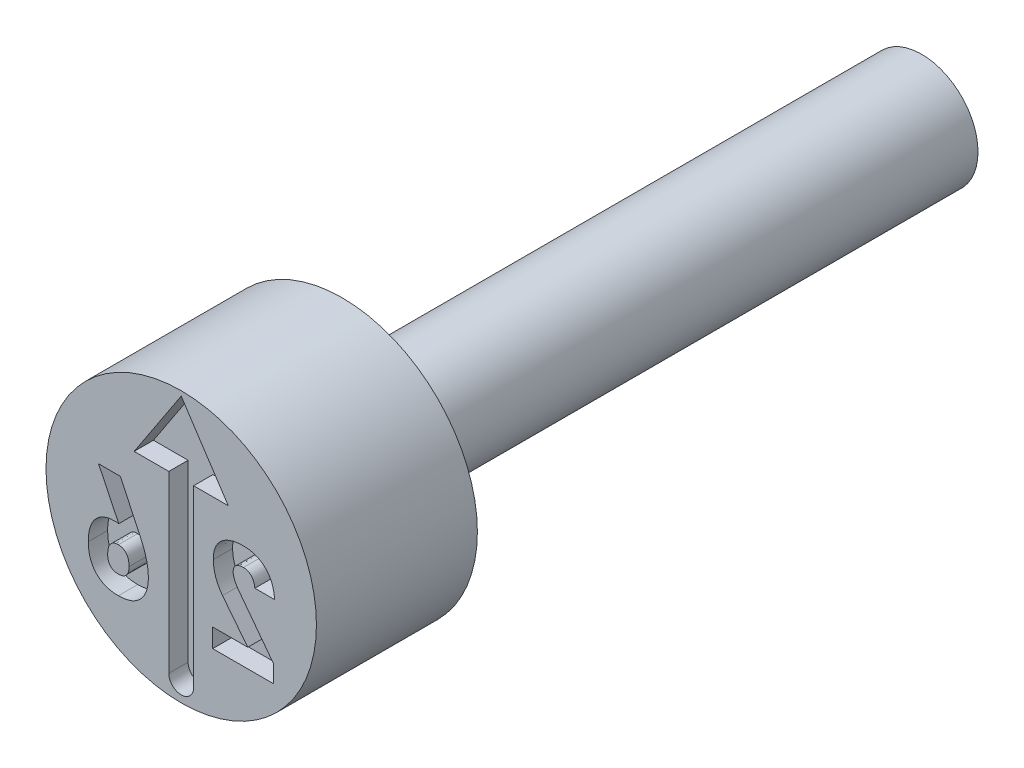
ISO-10303-21;
HEADER;
FILE_DESCRIPTION(('STEP AP214'),'2;1');
FILE_NAME('part.step','',(''),(''),'','','');
FILE_SCHEMA(('AUTOMOTIVE_DESIGN { 1 0 10303 214 1 1 1 1 }'));
ENDSEC;
DATA;
#1=APPLICATION_CONTEXT('core data for automotive mechanical design processes');
#2=APPLICATION_PROTOCOL_DEFINITION('international standard','automotive_design',2000,#1);
#3=PRODUCT_CONTEXT('',#1,'mechanical');
#4=PRODUCT('Part','Part','',(#3));
#5=PRODUCT_RELATED_PRODUCT_CATEGORY('part','',(#4));
#6=PRODUCT_DEFINITION_FORMATION('','',#4);
#7=PRODUCT_DEFINITION_CONTEXT('part definition',#1,'design');
#8=PRODUCT_DEFINITION('design','',#6,#7);
#9=PRODUCT_DEFINITION_SHAPE('','',#8);
#10=(LENGTH_UNIT() NAMED_UNIT(*) SI_UNIT(.MILLI.,.METRE.));
#11=(NAMED_UNIT(*) PLANE_ANGLE_UNIT() SI_UNIT($,.RADIAN.));
#12=(NAMED_UNIT(*) SI_UNIT($,.STERADIAN.) SOLID_ANGLE_UNIT());
#13=UNCERTAINTY_MEASURE_WITH_UNIT(LENGTH_MEASURE(1.E-05),#10,'distance_accuracy_value','');
#14=(GEOMETRIC_REPRESENTATION_CONTEXT(3) GLOBAL_UNCERTAINTY_ASSIGNED_CONTEXT((#13)) GLOBAL_UNIT_ASSIGNED_CONTEXT((#10,
#11,#12)) REPRESENTATION_CONTEXT('',''));
#15=CARTESIAN_POINT('',(0.,0.,0.));
#16=DIRECTION('',(0.,0.,1.));
#17=DIRECTION('',(1.,0.,0.));
#18=AXIS2_PLACEMENT_3D('',#15,#16,#17);
#19=CARTESIAN_POINT('',(0.,4.2,0.));
#20=DIRECTION('',(0.,0.,-1.));
#21=DIRECTION('',(-1.,0.,0.));
#22=AXIS2_PLACEMENT_3D('',#19,#20,#21);
#23=PLANE('',#22);
#24=DIRECTION('',(0.,1.,0.));
#25=VECTOR('',#24,1.);
#26=CARTESIAN_POINT('',(2.86298701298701,-2.25,0.));
#27=LINE('',#26,#25);
#28=CARTESIAN_POINT('',(2.86298701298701,-2.25,0.));
#29=VERTEX_POINT('',#28);
#30=CARTESIAN_POINT('',(2.86298701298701,-1.70584415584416,0.));
#31=VERTEX_POINT('',#30);
#32=EDGE_CURVE('E513',#29,#31,#27,.T.);
#33=ORIENTED_EDGE('',*,*,#32,.F.);
#34=DIRECTION('',(1.,0.,0.));
#35=VECTOR('',#34,1.);
#36=CARTESIAN_POINT('',(0.978571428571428,-2.25,0.));
#37=LINE('',#36,#35);
#38=CARTESIAN_POINT('',(0.978571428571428,-2.25,0.));
#39=VERTEX_POINT('',#38);
#40=EDGE_CURVE('E54',#39,#29,#37,.T.);
#41=ORIENTED_EDGE('',*,*,#40,.F.);
#42=DIRECTION('',(0.,-1.,0.));
#43=VECTOR('',#42,1.);
#44=CARTESIAN_POINT('',(0.978571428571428,-1.66818181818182,0.));
#45=LINE('',#44,#43);
#46=CARTESIAN_POINT('',(0.978571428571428,-1.66818181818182,0.));
#47=VERTEX_POINT('',#46);
#48=EDGE_CURVE('E317',#47,#39,#45,.T.);
#49=ORIENTED_EDGE('',*,*,#48,.F.);
#50=DIRECTION('',(-1.,0.,0.));
#51=VECTOR('',#50,1.);
#52=CARTESIAN_POINT('',(2.06753246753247,-1.66818181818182,0.));
#53=LINE('',#52,#51);
#54=CARTESIAN_POINT('',(2.06753246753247,-1.66818181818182,0.));
#55=VERTEX_POINT('',#54);
#56=EDGE_CURVE('E320',#55,#47,#53,.T.);
#57=ORIENTED_EDGE('',*,*,#56,.F.);
#58=DIRECTION('',(0.618183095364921,-0.786034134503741,0.));
#59=VECTOR('',#58,1.);
#60=CARTESIAN_POINT('',(1.28311688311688,-0.67077922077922,0.));
#61=LINE('',#60,#59);
#62=CARTESIAN_POINT('',(1.28311688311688,-0.67077922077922,0.));
#63=VERTEX_POINT('',#62);
#64=EDGE_CURVE('E1329',#63,#55,#61,.T.);
#65=ORIENTED_EDGE('',*,*,#64,.F.);
#66=CARTESIAN_POINT('',(0.996103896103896,0.152597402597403,0.));
#67=CARTESIAN_POINT('',(0.996931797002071,0.116187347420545,0.));
#68=CARTESIAN_POINT('',(0.998589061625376,0.0433029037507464,0.));
#69=CARTESIAN_POINT('',(1.01354853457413,-0.0657788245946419,0.));
#70=CARTESIAN_POINT('',(1.03765543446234,-0.174303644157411,0.));
#71=CARTESIAN_POINT('',(1.0707627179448,-0.281747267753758,0.));
#72=CARTESIAN_POINT('',(1.11189043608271,-0.386248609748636,0.));
#73=CARTESIAN_POINT('',(1.16125160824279,-0.486376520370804,0.));
#74=CARTESIAN_POINT('',(1.21696202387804,-0.582175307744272,0.));
#75=CARTESIAN_POINT('',(1.2611074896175,-0.641301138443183,0.));
#76=CARTESIAN_POINT('',(1.28311688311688,-0.67077922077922,0.));
#77=B_SPLINE_CURVE_WITH_KNOTS('',3,(#66,#67,#68,#69,#70,#71,#72,#73,#74,#75,#76),.UNSPECIFIED.,
.F.,.F.,(4,1,1,1,1,1,1,1,4),(0.,0.123046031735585,0.246309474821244,0.371480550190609,
0.498560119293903,0.626024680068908,0.750715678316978,0.875715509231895,1.),.UNSPECIFIED.);
#78=CARTESIAN_POINT('',(0.996103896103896,0.152597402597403,0.));
#79=VERTEX_POINT('',#78);
#80=EDGE_CURVE('E1324',#79,#63,#77,.T.);
#81=ORIENTED_EDGE('',*,*,#80,.F.);
#82=DIRECTION('',(0.,-1.,0.));
#83=VECTOR('',#82,1.);
#84=CARTESIAN_POINT('',(0.996103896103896,0.155194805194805,0.));
#85=LINE('',#84,#83);
#86=CARTESIAN_POINT('',(0.996103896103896,0.155194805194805,0.));
#87=VERTEX_POINT('',#86);
#88=EDGE_CURVE('E1318',#87,#79,#85,.T.);
#89=ORIENTED_EDGE('',*,*,#88,.F.);
#90=CARTESIAN_POINT('',(1.93831168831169,0.991558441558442,0.));
#91=CARTESIAN_POINT('',(1.90191870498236,0.991041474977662,0.));
#92=CARTESIAN_POINT('',(1.83113916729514,0.990036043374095,0.));
#93=CARTESIAN_POINT('',(1.72809640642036,0.979182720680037,0.));
#94=CARTESIAN_POINT('',(1.63114409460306,0.962801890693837,0.));
#95=CARTESIAN_POINT('',(1.54043824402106,0.938837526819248,0.));
#96=CARTESIAN_POINT('',(1.45634299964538,0.907578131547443,0.));
#97=CARTESIAN_POINT('',(1.37860644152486,0.869886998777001,0.));
#98=CARTESIAN_POINT('',(1.30706606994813,0.825442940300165,0.));
#99=CARTESIAN_POINT('',(1.24226977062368,0.774150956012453,0.));
#100=CARTESIAN_POINT('',(1.18396911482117,0.716942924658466,0.));
#101=CARTESIAN_POINT('',(1.13378797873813,0.653238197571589,0.));
#102=CARTESIAN_POINT('',(1.09034788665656,0.584324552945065,0.));
#103=CARTESIAN_POINT('',(1.05639106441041,0.508865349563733,0.));
#104=CARTESIAN_POINT('',(1.02843507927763,0.42863512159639,0.));
#105=CARTESIAN_POINT('',(1.01033401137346,0.342195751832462,0.));
#106=CARTESIAN_POINT('',(0.998136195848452,0.250564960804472,0.));
#107=CARTESIAN_POINT('',(0.996792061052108,0.18748846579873,0.));
#108=CARTESIAN_POINT('',(0.996103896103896,0.155194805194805,0.));
#109=B_SPLINE_CURVE_WITH_KNOTS('',3,(#90,#91,#92,#93,#94,#95,#96,#97,#98,#99,#100,#101,#102,
#103,#104,#105,#106,#107,#108),.UNSPECIFIED.,.F.,.F.,(4,1,1,1,1,1,1,1,1,1,1,1,1,1,1,1,4),(0.,
0.0762312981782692,0.148259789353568,0.216860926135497,0.28210063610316,0.344528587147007,
0.404571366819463,0.462840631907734,0.520642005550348,0.577409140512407,0.633580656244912,
0.690215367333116,0.747647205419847,0.806597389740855,0.867894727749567,0.932365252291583,1.),.UNSPECIFIED.);
#110=CARTESIAN_POINT('',(1.93831168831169,0.991558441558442,0.));
#111=VERTEX_POINT('',#110);
#112=EDGE_CURVE('E1310',#111,#87,#109,.T.);
#113=ORIENTED_EDGE('',*,*,#112,.F.);
#114=CARTESIAN_POINT('',(2.9025974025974,0.0311688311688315,0.));
#115=CARTESIAN_POINT('',(2.89955987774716,0.0682613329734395,0.));
#116=CARTESIAN_POINT('',(2.8936306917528,0.140665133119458,0.));
#117=CARTESIAN_POINT('',(2.87419224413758,0.245400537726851,0.));
#118=CARTESIAN_POINT('',(2.84906881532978,0.344054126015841,0.));
#119=CARTESIAN_POINT('',(2.81710842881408,0.436606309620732,0.));
#120=CARTESIAN_POINT('',(2.77603921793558,0.521985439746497,0.));
#121=CARTESIAN_POINT('',(2.72989671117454,0.601976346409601,0.));
#122=CARTESIAN_POINT('',(2.67439883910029,0.674104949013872,0.));
#123=CARTESIAN_POINT('',(2.61364864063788,0.740784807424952,0.));
#124=CARTESIAN_POINT('',(2.54598378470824,0.799515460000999,0.));
#125=CARTESIAN_POINT('',(2.47383445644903,0.85132377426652,0.));
#126=CARTESIAN_POINT('',(2.39610964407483,0.894436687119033,0.));
#127=CARTESIAN_POINT('',(2.31399097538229,0.930201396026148,0.));
#128=CARTESIAN_POINT('',(2.22656798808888,0.957345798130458,0.));
#129=CARTESIAN_POINT('',(2.13498263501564,0.977679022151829,0.));
#130=CARTESIAN_POINT('',(2.03818368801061,0.989405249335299,0.));
#131=CARTESIAN_POINT('',(1.97210928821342,0.990829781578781,0.));
#132=CARTESIAN_POINT('',(1.93831168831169,0.991558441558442,0.));
#133=B_SPLINE_CURVE_WITH_KNOTS('',3,(#114,#115,#116,#117,#118,#119,#120,#121,#122,#123,#124,
#125,#126,#127,#128,#129,#130,#131,#132),.UNSPECIFIED.,.F.,.F.,(4,1,1,1,1,1,1,1,1,1,1,1,1,1,1,1,
4),(0.,0.0733268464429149,0.14313249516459,0.209679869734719,0.273918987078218,0.33576228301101,
0.396210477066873,0.45560885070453,0.514796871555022,0.573764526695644,0.631900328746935,
0.689592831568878,0.748648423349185,0.808163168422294,0.86976604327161,0.933384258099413,1.),.UNSPECIFIED.);
#134=CARTESIAN_POINT('',(2.9025974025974,0.0311688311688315,0.));
#135=VERTEX_POINT('',#134);
#136=EDGE_CURVE('E1305',#135,#111,#133,.T.);
#137=ORIENTED_EDGE('',*,*,#136,.F.);
#138=DIRECTION('',(0.,1.,0.));
#139=VECTOR('',#138,1.);
#140=CARTESIAN_POINT('',(2.9025974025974,0.0292207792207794,0.));
#141=LINE('',#140,#139);
#142=CARTESIAN_POINT('',(2.9025974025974,0.0292207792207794,0.));
#143=VERTEX_POINT('',#142);
#144=EDGE_CURVE('E1302',#143,#135,#141,.T.);
#145=ORIENTED_EDGE('',*,*,#144,.F.);
#146=DIRECTION('',(1.,0.,0.));
#147=VECTOR('',#146,1.);
#148=CARTESIAN_POINT('',(2.28701298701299,0.0292207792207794,0.));
#149=LINE('',#148,#147);
#150=CARTESIAN_POINT('',(2.28701298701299,0.0292207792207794,0.));
#151=VERTEX_POINT('',#150);
#152=EDGE_CURVE('E1299',#151,#143,#149,.T.);
#153=ORIENTED_EDGE('',*,*,#152,.F.);
#154=DIRECTION('',(0.,-1.,0.));
#155=VECTOR('',#154,1.);
#156=CARTESIAN_POINT('',(2.28701298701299,0.0311688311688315,0.));
#157=LINE('',#156,#155);
#158=CARTESIAN_POINT('',(2.28701298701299,0.0311688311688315,0.));
#159=VERTEX_POINT('',#158);
#160=EDGE_CURVE('E1293',#159,#151,#157,.T.);
#161=ORIENTED_EDGE('',*,*,#160,.F.);
#162=CARTESIAN_POINT('',(1.93376623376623,0.40974025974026,0.));
#163=CARTESIAN_POINT('',(1.95729092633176,0.408822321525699,0.));
#164=CARTESIAN_POINT('',(2.00300022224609,0.407038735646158,0.));
#165=CARTESIAN_POINT('',(2.06770952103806,0.38727157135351,0.));
#166=CARTESIAN_POINT('',(2.12601890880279,0.356265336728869,0.));
#167=CARTESIAN_POINT('',(2.17628623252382,0.312023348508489,0.));
#168=CARTESIAN_POINT('',(2.21791138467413,0.25647586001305,0.));
#169=CARTESIAN_POINT('',(2.25169422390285,0.191064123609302,0.));
#170=CARTESIAN_POINT('',(2.27463927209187,0.114607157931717,0.));
#171=CARTESIAN_POINT('',(2.28275569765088,0.059876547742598,0.));
#172=CARTESIAN_POINT('',(2.28701298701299,0.0311688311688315,0.));
#173=B_SPLINE_CURVE_WITH_KNOTS('',3,(#162,#163,#164,#165,#166,#167,#168,#169,#170,#171,#172),
.UNSPECIFIED.,.F.,.F.,(4,1,1,1,1,1,1,1,4),(0.,0.122603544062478,0.238222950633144,
0.350089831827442,0.465559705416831,0.58502806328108,0.711014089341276,0.848418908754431,1.),.UNSPECIFIED.);
#174=CARTESIAN_POINT('',(1.93376623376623,0.40974025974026,0.));
#175=VERTEX_POINT('',#174);
#176=EDGE_CURVE('E1285',#175,#159,#173,.T.);
#177=ORIENTED_EDGE('',*,*,#176,.F.);
#178=CARTESIAN_POINT('',(1.61428571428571,0.138311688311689,0.));
#179=CARTESIAN_POINT('',(1.61517276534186,0.158772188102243,0.));
#180=CARTESIAN_POINT('',(1.61687221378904,0.19797124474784,0.));
#181=CARTESIAN_POINT('',(1.63288368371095,0.253203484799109,0.));
#182=CARTESIAN_POINT('',(1.65912562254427,0.30130232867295,0.));
#183=CARTESIAN_POINT('',(1.69671041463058,0.341031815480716,0.));
#184=CARTESIAN_POINT('',(1.74350060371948,0.372455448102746,0.));
#185=CARTESIAN_POINT('',(1.7994863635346,0.394600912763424,0.));
#186=CARTESIAN_POINT('',(1.8639351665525,0.407299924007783,0.));
#187=CARTESIAN_POINT('',(1.90968069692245,0.408898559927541,0.));
#188=CARTESIAN_POINT('',(1.93376623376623,0.40974025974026,0.));
#189=B_SPLINE_CURVE_WITH_KNOTS('',3,(#178,#179,#180,#181,#182,#183,#184,#185,#186,#187,#188),
.UNSPECIFIED.,.F.,.F.,(4,1,1,1,1,1,1,1,4),(0.,0.128749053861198,0.246662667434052,
0.359069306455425,0.47107757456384,0.588039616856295,0.711712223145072,0.848213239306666,1.),.UNSPECIFIED.);
#190=CARTESIAN_POINT('',(1.61428571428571,0.138311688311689,0.));
#191=VERTEX_POINT('',#190);
#192=EDGE_CURVE('E1280',#191,#175,#189,.T.);
#193=ORIENTED_EDGE('',*,*,#192,.F.);
#194=DIRECTION('',(0.,1.,0.));
#195=VECTOR('',#194,1.);
#196=CARTESIAN_POINT('',(1.61428571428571,0.133766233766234,0.));
#197=LINE('',#196,#195);
#198=CARTESIAN_POINT('',(1.61428571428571,0.133766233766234,0.));
#199=VERTEX_POINT('',#198);
#200=EDGE_CURVE('E1274',#199,#191,#197,.T.);
#201=ORIENTED_EDGE('',*,*,#200,.F.);
#202=CARTESIAN_POINT('',(1.76948051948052,-0.257142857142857,0.));
#203=CARTESIAN_POINT('',(1.74657683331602,-0.224870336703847,0.));
#204=CARTESIAN_POINT('',(1.70194969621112,-0.161988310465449,0.));
#205=CARTESIAN_POINT('',(1.66155869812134,-0.0756325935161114,0.));
#206=CARTESIAN_POINT('',(1.6363967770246,-0.00792863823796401,0.));
#207=CARTESIAN_POINT('',(1.62440516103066,0.0411700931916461,0.));
#208=CARTESIAN_POINT('',(1.61585071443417,0.0880148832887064,0.));
#209=CARTESIAN_POINT('',(1.61479780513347,0.118795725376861,0.));
#210=CARTESIAN_POINT('',(1.61428571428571,0.133766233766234,0.));
#211=B_SPLINE_CURVE_WITH_KNOTS('',3,(#202,#203,#204,#205,#206,#207,#208,#209,#210),
.UNSPECIFIED.,.F.,.F.,(4,1,1,1,1,1,4),(0.,0.277375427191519,0.540457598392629,0.666416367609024,
0.784009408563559,0.894951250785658,1.),.UNSPECIFIED.);
#212=CARTESIAN_POINT('',(1.76948051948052,-0.257142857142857,0.));
#213=VERTEX_POINT('',#212);
#214=EDGE_CURVE('E1269',#213,#199,#211,.T.);
#215=ORIENTED_EDGE('',*,*,#214,.F.);
#216=DIRECTION('',(-0.602458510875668,0.798150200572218,0.));
#217=VECTOR('',#216,1.);
#218=CARTESIAN_POINT('',(2.86298701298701,-1.70584415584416,0.));
#219=LINE('',#218,#217);
#220=EDGE_CURVE('E1266',#31,#213,#219,.T.);
#221=ORIENTED_EDGE('',*,*,#220,.F.);
#222=EDGE_LOOP('',(#33,#41,#49,#57,#65,#81,#89,#113,#137,#145,#153,#161,#177,#193,#201,#215,#221));
#223=FACE_BOUND('',#222,.T.);
#224=CARTESIAN_POINT('',(-1.95174025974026,-2.29155844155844,0.));
#225=CARTESIAN_POINT('',(-1.91577935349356,-2.2908371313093,0.));
#226=CARTESIAN_POINT('',(-1.84582184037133,-2.28943391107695,0.));
#227=CARTESIAN_POINT('',(-1.74405281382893,-2.27779933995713,0.));
#228=CARTESIAN_POINT('',(-1.64865840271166,-2.25759070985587,0.));
#229=CARTESIAN_POINT('',(-1.55921978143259,-2.22970151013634,0.));
#230=CARTESIAN_POINT('',(-1.47573379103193,-2.19405086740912,0.));
#231=CARTESIAN_POINT('',(-1.39857039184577,-2.15034355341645,0.));
#232=CARTESIAN_POINT('',(-1.32769144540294,-2.09854876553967,0.));
#233=CARTESIAN_POINT('',(-1.26345544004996,-2.03877838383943,0.));
#234=CARTESIAN_POINT('',(-1.20631401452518,-1.97177799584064,0.));
#235=CARTESIAN_POINT('',(-1.15640250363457,-1.89820207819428,0.));
#236=CARTESIAN_POINT('',(-1.11414217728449,-1.8180744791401,0.));
#237=CARTESIAN_POINT('',(-1.07986701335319,-1.73135430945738,0.));
#238=CARTESIAN_POINT('',(-1.05298378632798,-1.6383085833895,0.));
#239=CARTESIAN_POINT('',(-1.03480141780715,-1.53887319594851,0.));
#240=CARTESIAN_POINT('',(-1.02255576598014,-1.43298704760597,0.));
#241=CARTESIAN_POINT('',(-1.02124600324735,-1.36021003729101,0.));
#242=CARTESIAN_POINT('',(-1.02057142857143,-1.32272727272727,0.));
#243=B_SPLINE_CURVE_WITH_KNOTS('',3,(#224,#225,#226,#227,#228,#229,#230,#231,#232,#233,#234,
#235,#236,#237,#238,#239,#240,#241,#242),.UNSPECIFIED.,.F.,.F.,(4,1,1,1,1,1,1,1,1,1,1,1,1,1,1,1,
4),(0.,0.0706034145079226,0.137350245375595,0.20079014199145,0.261822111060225,
0.321037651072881,0.378713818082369,0.435588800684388,0.493032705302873,0.550614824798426,
0.60814515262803,0.667276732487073,0.728130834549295,0.790952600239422,0.85714223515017,
0.926423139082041,1.),.UNSPECIFIED.);
#244=CARTESIAN_POINT('',(-1.95174025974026,-2.29155844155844,0.));
#245=VERTEX_POINT('',#244);
#246=CARTESIAN_POINT('',(-1.02057142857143,-1.32272727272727,0.));
#247=VERTEX_POINT('',#246);
#248=EDGE_CURVE('E518',#245,#247,#243,.T.);
#249=ORIENTED_EDGE('',*,*,#248,.F.);
#250=CARTESIAN_POINT('',(-2.88550649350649,-1.3051948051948,0.));
#251=CARTESIAN_POINT('',(-2.88480809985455,-1.34310726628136,0.));
#252=CARTESIAN_POINT('',(-2.88344373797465,-1.41717196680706,0.));
#253=CARTESIAN_POINT('',(-2.87140896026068,-1.52481563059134,0.));
#254=CARTESIAN_POINT('',(-2.85296912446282,-1.62613826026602,0.));
#255=CARTESIAN_POINT('',(-2.82634731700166,-1.72076765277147,0.));
#256=CARTESIAN_POINT('',(-2.79191072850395,-1.80893894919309,0.));
#257=CARTESIAN_POINT('',(-2.74960590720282,-1.89068191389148,0.));
#258=CARTESIAN_POINT('',(-2.69923821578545,-1.96559310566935,0.));
#259=CARTESIAN_POINT('',(-2.64224011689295,-2.03421566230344,0.));
#260=CARTESIAN_POINT('',(-2.57755111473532,-2.0946005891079,0.));
#261=CARTESIAN_POINT('',(-2.50690621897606,-2.1476592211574,0.));
#262=CARTESIAN_POINT('',(-2.43005682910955,-2.19299250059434,0.));
#263=CARTESIAN_POINT('',(-2.34586519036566,-2.22825826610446,0.));
#264=CARTESIAN_POINT('',(-2.25625735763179,-2.25720733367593,0.));
#265=CARTESIAN_POINT('',(-2.15999996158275,-2.27687149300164,0.));
#266=CARTESIAN_POINT('',(-2.05793055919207,-2.28965577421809,0.));
#267=CARTESIAN_POINT('',(-1.98771182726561,-2.29091392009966,0.));
#268=CARTESIAN_POINT('',(-1.95174025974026,-2.29155844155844,0.));
#269=B_SPLINE_CURVE_WITH_KNOTS('',3,(#250,#251,#252,#253,#254,#255,#256,#257,#258,#259,#260,
#261,#262,#263,#264,#265,#266,#267,#268),.UNSPECIFIED.,.F.,.F.,(4,1,1,1,1,1,1,1,1,1,1,1,1,1,1,1,
4),(0.,0.0736363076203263,0.143853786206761,0.210167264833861,0.273535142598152,
0.334525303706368,0.393774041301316,0.451974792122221,0.509587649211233,0.566708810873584,
0.623480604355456,0.68096439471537,0.739551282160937,0.800463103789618,0.863640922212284,
0.930146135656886,1.),.UNSPECIFIED.);
#270=CARTESIAN_POINT('',(-2.88550649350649,-1.3051948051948,0.));
#271=VERTEX_POINT('',#270);
#272=EDGE_CURVE('E62',#271,#245,#269,.T.);
#273=ORIENTED_EDGE('',*,*,#272,.F.);
#274=DIRECTION('',(0.,-1.,0.));
#275=VECTOR('',#274,1.);
#276=CARTESIAN_POINT('',(-2.88550649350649,-1.3025974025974,0.));
#277=LINE('',#276,#275);
#278=CARTESIAN_POINT('',(-2.88550649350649,-1.3025974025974,0.));
#279=VERTEX_POINT('',#278);
#280=EDGE_CURVE('E438',#279,#271,#277,.T.);
#281=ORIENTED_EDGE('',*,*,#280,.F.);
#282=CARTESIAN_POINT('',(-2.05498701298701,-0.338311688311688,0.));
#283=CARTESIAN_POINT('',(-2.08705356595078,-0.339038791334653,0.));
#284=CARTESIAN_POINT('',(-2.1494632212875,-0.340453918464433,0.));
#285=CARTESIAN_POINT('',(-2.24027453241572,-0.352031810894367,0.));
#286=CARTESIAN_POINT('',(-2.32514452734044,-0.372549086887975,0.));
#287=CARTESIAN_POINT('',(-2.40514158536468,-0.399482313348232,0.));
#288=CARTESIAN_POINT('',(-2.47942582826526,-0.435397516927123,0.));
#289=CARTESIAN_POINT('',(-2.5481814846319,-0.479343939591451,0.));
#290=CARTESIAN_POINT('',(-2.61156880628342,-0.530794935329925,0.));
#291=CARTESIAN_POINT('',(-2.66875238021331,-0.59036832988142,0.));
#292=CARTESIAN_POINT('',(-2.72026845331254,-0.656544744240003,0.));
#293=CARTESIAN_POINT('',(-2.76441562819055,-0.729992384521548,0.));
#294=CARTESIAN_POINT('',(-2.80235444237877,-0.809484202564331,0.));
#295=CARTESIAN_POINT('',(-2.8325792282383,-0.89581509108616,0.));
#296=CARTESIAN_POINT('',(-2.8568030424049,-0.98828364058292,0.));
#297=CARTESIAN_POINT('',(-2.87315947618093,-1.08741472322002,0.));
#298=CARTESIAN_POINT('',(-2.88397660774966,-1.19283302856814,0.));
#299=CARTESIAN_POINT('',(-2.88498719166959,-1.26533916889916,0.));
#300=CARTESIAN_POINT('',(-2.88550649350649,-1.3025974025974,0.));
#301=B_SPLINE_CURVE_WITH_KNOTS('',3,(#282,#283,#284,#285,#286,#287,#288,#289,#290,#291,#292,
#293,#294,#295,#296,#297,#298,#299,#300),.UNSPECIFIED.,.F.,.F.,(4,1,1,1,1,1,1,1,1,1,1,1,1,1,1,1,
4),(0.,0.0665766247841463,0.129575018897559,0.18964484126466,0.24763903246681,0.30453064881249,
0.36051483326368,0.416743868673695,0.473642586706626,0.531631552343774,0.590524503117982,
0.65124161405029,0.714220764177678,0.780176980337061,0.849489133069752,0.922658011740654,1.),.UNSPECIFIED.);
#302=CARTESIAN_POINT('',(-2.05498701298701,-0.338311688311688,0.));
#303=VERTEX_POINT('',#302);
#304=EDGE_CURVE('E619',#303,#279,#301,.T.);
#305=ORIENTED_EDGE('',*,*,#304,.F.);
#306=CARTESIAN_POINT('',(-1.64914285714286,-0.556493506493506,0.));
#307=CARTESIAN_POINT('',(-1.65897998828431,-0.539019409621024,0.));
#308=CARTESIAN_POINT('',(-1.6782595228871,-0.504772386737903,0.));
#309=CARTESIAN_POINT('',(-1.71623725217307,-0.460448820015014,0.));
#310=CARTESIAN_POINT('',(-1.75859350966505,-0.421957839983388,0.));
#311=CARTESIAN_POINT('',(-1.80757915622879,-0.391343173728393,0.));
#312=CARTESIAN_POINT('',(-1.86174195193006,-0.367122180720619,0.));
#313=CARTESIAN_POINT('',(-1.92152489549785,-0.350609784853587,0.));
#314=CARTESIAN_POINT('',(-1.98641128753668,-0.339776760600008,0.));
#315=CARTESIAN_POINT('',(-2.03156288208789,-0.338812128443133,0.));
#316=CARTESIAN_POINT('',(-2.05498701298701,-0.338311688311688,0.));
#317=B_SPLINE_CURVE_WITH_KNOTS('',3,(#306,#307,#308,#309,#310,#311,#312,#313,#314,#315,#316),
.UNSPECIFIED.,.F.,.F.,(4,1,1,1,1,1,1,1,4),(0.,0.123274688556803,0.241602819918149,
0.357777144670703,0.47468395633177,0.595870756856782,0.722082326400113,0.855819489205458,1.),.UNSPECIFIED.);
#318=CARTESIAN_POINT('',(-1.93956306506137,-0.348047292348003,0.));
#319=VERTEX_POINT('',#318);
#320=EDGE_CURVE('E624',#319,#303,#317,.T.);
#321=ORIENTED_EDGE('',*,*,#320,.F.);
#322=DIRECTION('',(0.435377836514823,-0.900247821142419,0.));
#323=VECTOR('',#322,1.);
#324=CARTESIAN_POINT('',(-2.56732467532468,0.95,0.));
#325=LINE('',#324,#323);
#326=CARTESIAN_POINT('',(-2.56732467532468,0.95,0.));
#327=VERTEX_POINT('',#326);
#328=EDGE_CURVE('E632',#327,#319,#325,.T.);
#329=ORIENTED_EDGE('',*,*,#328,.F.);
#330=DIRECTION('',(-1.,0.,0.));
#331=VECTOR('',#330,1.);
#332=CARTESIAN_POINT('',(-1.8881038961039,0.95,0.));
#333=LINE('',#332,#331);
#334=CARTESIAN_POINT('',(-1.8881038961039,0.95,0.));
#335=VERTEX_POINT('',#334);
#336=EDGE_CURVE('E638',#335,#327,#333,.T.);
#337=ORIENTED_EDGE('',*,*,#336,.F.);
#338=DIRECTION('',(-0.424073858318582,0.905627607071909,0.));
#339=VECTOR('',#338,1.);
#340=CARTESIAN_POINT('',(-1.24135064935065,-0.431168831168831,0.));
#341=LINE('',#340,#339);
#342=CARTESIAN_POINT('',(-1.24135064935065,-0.431168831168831,0.));
#343=VERTEX_POINT('',#342);
#344=EDGE_CURVE('E641',#343,#335,#341,.T.);
#345=ORIENTED_EDGE('',*,*,#344,.F.);
#346=CARTESIAN_POINT('',(-1.02057142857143,-1.32077922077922,0.));
#347=CARTESIAN_POINT('',(-1.02139073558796,-1.28568653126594,0.));
#348=CARTESIAN_POINT('',(-1.02305841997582,-1.21425600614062,0.));
#349=CARTESIAN_POINT('',(-1.03468953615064,-1.10584174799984,0.));
#350=CARTESIAN_POINT('',(-1.05266117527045,-0.99452790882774,0.));
#351=CARTESIAN_POINT('',(-1.07902223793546,-0.881310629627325,0.));
#352=CARTESIAN_POINT('',(-1.11116579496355,-0.767348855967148,0.));
#353=CARTESIAN_POINT('',(-1.14924385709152,-0.653954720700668,0.));
#354=CARTESIAN_POINT('',(-1.19158474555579,-0.541395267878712,0.));
#355=CARTESIAN_POINT('',(-1.22471562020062,-0.468013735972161,0.));
#356=CARTESIAN_POINT('',(-1.24135064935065,-0.431168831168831,0.));
#357=B_SPLINE_CURVE_WITH_KNOTS('',3,(#346,#347,#348,#349,#350,#351,#352,#353,#354,#355,#356),
.UNSPECIFIED.,.F.,.F.,(4,1,1,1,1,1,1,1,4),(0.,0.114002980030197,0.232050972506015,
0.353906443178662,0.480147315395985,0.609491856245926,0.738474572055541,0.868687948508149,1.),.UNSPECIFIED.);
#358=CARTESIAN_POINT('',(-1.02057142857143,-1.32077922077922,0.));
#359=VERTEX_POINT('',#358);
#360=EDGE_CURVE('E644',#359,#343,#357,.T.);
#361=ORIENTED_EDGE('',*,*,#360,.F.);
#362=DIRECTION('',(0.,1.,0.));
#363=VECTOR('',#362,1.);
#364=CARTESIAN_POINT('',(-1.02057142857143,-1.32272727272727,0.));
#365=LINE('',#364,#363);
#366=EDGE_CURVE('E649',#247,#359,#365,.T.);
#367=ORIENTED_EDGE('',*,*,#366,.F.);
#368=EDGE_LOOP('',(#249,#273,#281,#305,#321,#329,#337,#345,#361,#367));
#369=FACE_BOUND('',#368,.T.);
#370=CARTESIAN_POINT('',(0.,0.,0.));
#371=DIRECTION('',(0.,0.,1.));
#372=DIRECTION('',(1.,0.,0.));
#373=AXIS2_PLACEMENT_3D('',#370,#371,#372);
#374=CIRCLE('',#373,4.2);
#375=CARTESIAN_POINT('',(4.2,0.,0.));
#376=VERTEX_POINT('',#375);
#377=EDGE_CURVE('E47',#376,#376,#374,.T.);
#378=ORIENTED_EDGE('',*,*,#377,.T.);
#379=EDGE_LOOP('',(#378));
#380=FACE_BOUND('',#379,.T.);
#381=DIRECTION('',(0.,1.,0.));
#382=VECTOR('',#381,1.);
#383=CARTESIAN_POINT('',(0.385708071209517,1.83536164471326,0.));
#384=LINE('',#383,#382);
#385=CARTESIAN_POINT('',(0.385708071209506,-3.59672771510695,0.));
#386=VERTEX_POINT('',#385);
#387=CARTESIAN_POINT('',(0.385708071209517,1.83536164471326,0.));
#388=VERTEX_POINT('',#387);
#389=EDGE_CURVE('E525',#386,#388,#384,.T.);
#390=ORIENTED_EDGE('',*,*,#389,.F.);
#391=CARTESIAN_POINT('',(3.30934598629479E-13,-3.59672771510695,0.));
#392=DIRECTION('',(0.,0.,1.));
#393=DIRECTION('',(1.,0.,0.));
#394=AXIS2_PLACEMENT_3D('',#391,#392,#393);
#395=CIRCLE('',#394,0.385708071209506);
#396=CARTESIAN_POINT('',(-0.385708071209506,-3.59672771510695,0.));
#397=VERTEX_POINT('',#396);
#398=EDGE_CURVE('E527',#397,#386,#395,.T.);
#399=ORIENTED_EDGE('',*,*,#398,.F.);
#400=DIRECTION('',(0.,-1.,0.));
#401=VECTOR('',#400,1.);
#402=CARTESIAN_POINT('',(-0.385708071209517,1.83536164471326,0.));
#403=LINE('',#402,#401);
#404=CARTESIAN_POINT('',(-0.385708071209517,1.83536164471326,0.));
#405=VERTEX_POINT('',#404);
#406=EDGE_CURVE('E547',#405,#397,#403,.T.);
#407=ORIENTED_EDGE('',*,*,#406,.F.);
#408=DIRECTION('',(1.,0.,0.));
#409=VECTOR('',#408,1.);
#410=CARTESIAN_POINT('',(-1.46188328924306,1.83536164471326,0.));
#411=LINE('',#410,#409);
#412=CARTESIAN_POINT('',(-1.46188328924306,1.83536164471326,0.));
#413=VERTEX_POINT('',#412);
#414=EDGE_CURVE('E544',#413,#405,#411,.T.);
#415=ORIENTED_EDGE('',*,*,#414,.F.);
#416=DIRECTION('',(-0.550159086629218,-0.835059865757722,0.));
#417=VECTOR('',#416,1.);
#418=CARTESIAN_POINT('',(0.,4.05428357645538,0.));
#419=LINE('',#418,#417);
#420=CARTESIAN_POINT('',(0.,4.05428357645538,0.));
#421=VERTEX_POINT('',#420);
#422=EDGE_CURVE('E541',#421,#413,#419,.T.);
#423=ORIENTED_EDGE('',*,*,#422,.F.);
#424=DIRECTION('',(-0.550159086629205,0.835059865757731,0.));
#425=VECTOR('',#424,1.);
#426=CARTESIAN_POINT('',(0.,4.05428357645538,0.));
#427=LINE('',#426,#425);
#428=CARTESIAN_POINT('',(1.46188328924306,1.83536164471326,0.));
#429=VERTEX_POINT('',#428);
#430=EDGE_CURVE('E533',#429,#421,#427,.T.);
#431=ORIENTED_EDGE('',*,*,#430,.F.);
#432=DIRECTION('',(1.,0.,0.));
#433=VECTOR('',#432,1.);
#434=CARTESIAN_POINT('',(1.46188328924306,1.83536164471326,0.));
#435=LINE('',#434,#433);
#436=EDGE_CURVE('E530',#388,#429,#435,.T.);
#437=ORIENTED_EDGE('',*,*,#436,.F.);
#438=EDGE_LOOP('',(#390,#399,#407,#415,#423,#431,#437));
#439=FACE_BOUND('',#438,.T.);
#440=ADVANCED_FACE('F39',(#223,#369,#380,#439),#23,.F.);
#441=CARTESIAN_POINT('',(0.,1.75,-5.));
#442=DIRECTION('',(0.,0.,1.));
#443=DIRECTION('',(1.,0.,0.));
#444=AXIS2_PLACEMENT_3D('',#441,#442,#443);
#445=PLANE('',#444);
#446=CARTESIAN_POINT('',(0.,0.,-5.));
#447=DIRECTION('',(0.,0.,1.));
#448=DIRECTION('',(1.,0.,0.));
#449=AXIS2_PLACEMENT_3D('',#446,#447,#448);
#450=CIRCLE('',#449,4.2);
#451=CARTESIAN_POINT('',(4.2,0.,-5.));
#452=VERTEX_POINT('',#451);
#453=EDGE_CURVE('E11',#452,#452,#450,.T.);
#454=ORIENTED_EDGE('',*,*,#453,.F.);
#455=EDGE_LOOP('',(#454));
#456=FACE_BOUND('',#455,.T.);
#457=CARTESIAN_POINT('',(0.,0.,-5.));
#458=DIRECTION('',(0.,0.,1.));
#459=DIRECTION('',(1.,0.,0.));
#460=AXIS2_PLACEMENT_3D('',#457,#458,#459);
#461=CIRCLE('',#460,1.75);
#462=CARTESIAN_POINT('',(1.75,0.,-5.));
#463=VERTEX_POINT('',#462);
#464=EDGE_CURVE('E553',#463,#463,#461,.T.);
#465=ORIENTED_EDGE('',*,*,#464,.T.);
#466=EDGE_LOOP('',(#465));
#467=FACE_BOUND('',#466,.T.);
#468=ADVANCED_FACE('F41',(#456,#467),#445,.F.);
#469=CARTESIAN_POINT('',(0.,0.,-0.403888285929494));
#470=DIRECTION('',(0.,0.,1.));
#471=DIRECTION('',(1.,0.,0.));
#472=AXIS2_PLACEMENT_3D('',#469,#470,#471);
#473=CYLINDRICAL_SURFACE('',#472,4.2);
#474=ORIENTED_EDGE('',*,*,#377,.F.);
#475=EDGE_LOOP('',(#474));
#476=FACE_BOUND('',#475,.T.);
#477=ORIENTED_EDGE('',*,*,#453,.T.);
#478=EDGE_LOOP('',(#477));
#479=FACE_BOUND('',#478,.T.);
#480=ADVANCED_FACE('F494',(#476,#479),#473,.T.);
#481=CARTESIAN_POINT('',(0.,0.,-23.));
#482=DIRECTION('',(0.,0.,1.));
#483=DIRECTION('',(1.,0.,0.));
#484=AXIS2_PLACEMENT_3D('',#481,#482,#483);
#485=PLANE('',#484);
#486=CARTESIAN_POINT('',(0.,0.,-23.));
#487=DIRECTION('',(0.,0.,1.));
#488=DIRECTION('',(1.,0.,0.));
#489=AXIS2_PLACEMENT_3D('',#486,#487,#488);
#490=CIRCLE('',#489,1.75);
#491=CARTESIAN_POINT('',(1.75,0.,-23.));
#492=VERTEX_POINT('',#491);
#493=EDGE_CURVE('E569',#492,#492,#490,.T.);
#494=ORIENTED_EDGE('',*,*,#493,.F.);
#495=EDGE_LOOP('',(#494));
#496=FACE_BOUND('',#495,.T.);
#497=ADVANCED_FACE('F490',(#496),#485,.F.);
#498=CARTESIAN_POINT('',(0.,0.,-0.403888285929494));
#499=DIRECTION('',(0.,0.,1.));
#500=DIRECTION('',(1.,0.,0.));
#501=AXIS2_PLACEMENT_3D('',#498,#499,#500);
#502=CYLINDRICAL_SURFACE('',#501,1.75);
#503=ORIENTED_EDGE('',*,*,#464,.F.);
#504=EDGE_LOOP('',(#503));
#505=FACE_BOUND('',#504,.T.);
#506=ORIENTED_EDGE('',*,*,#493,.T.);
#507=EDGE_LOOP('',(#506));
#508=FACE_BOUND('',#507,.T.);
#509=ADVANCED_FACE('F486',(#505,#508),#502,.T.);
#510=CARTESIAN_POINT('',(3.30934598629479E-13,-3.59672771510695,-0.6));
#511=DIRECTION('',(0.,0.,1.));
#512=DIRECTION('',(1.,0.,0.));
#513=AXIS2_PLACEMENT_3D('',#510,#511,#512);
#514=CYLINDRICAL_SURFACE('',#513,0.385708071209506);
#515=ORIENTED_EDGE('',*,*,#398,.T.);
#516=DIRECTION('',(0.,0.,1.));
#517=VECTOR('',#516,1.);
#518=CARTESIAN_POINT('',(0.385708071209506,-3.59672771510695,-0.6));
#519=LINE('',#518,#517);
#520=CARTESIAN_POINT('',(0.385708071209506,-3.59672771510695,-0.6));
#521=VERTEX_POINT('',#520);
#522=EDGE_CURVE('E564',#521,#386,#519,.T.);
#523=ORIENTED_EDGE('',*,*,#522,.F.);
#524=CARTESIAN_POINT('',(3.30934598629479E-13,-3.59672771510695,-0.6));
#525=DIRECTION('',(0.,0.,1.));
#526=DIRECTION('',(1.,0.,0.));
#527=AXIS2_PLACEMENT_3D('',#524,#525,#526);
#528=CIRCLE('',#527,0.385708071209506);
#529=CARTESIAN_POINT('',(-0.385708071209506,-3.59672771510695,-0.6));
#530=VERTEX_POINT('',#529);
#531=EDGE_CURVE('E550',#530,#521,#528,.T.);
#532=ORIENTED_EDGE('',*,*,#531,.F.);
#533=DIRECTION('',(0.,0.,1.));
#534=VECTOR('',#533,1.);
#535=CARTESIAN_POINT('',(-0.385708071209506,-3.59672771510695,-0.6));
#536=LINE('',#535,#534);
#537=EDGE_CURVE('E551',#530,#397,#536,.T.);
#538=ORIENTED_EDGE('',*,*,#537,.T.);
#539=EDGE_LOOP('',(#515,#523,#532,#538));
#540=FACE_BOUND('',#539,.T.);
#541=ADVANCED_FACE('F464',(#540),#514,.F.);
#542=CARTESIAN_POINT('',(-0.385708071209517,1.83536164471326,-0.6));
#543=DIRECTION('',(-1.,0.,0.));
#544=DIRECTION('',(0.,-1.,0.));
#545=AXIS2_PLACEMENT_3D('',#542,#543,#544);
#546=PLANE('',#545);
#547=ORIENTED_EDGE('',*,*,#406,.T.);
#548=ORIENTED_EDGE('',*,*,#537,.F.);
#549=DIRECTION('',(0.,-1.,0.));
#550=VECTOR('',#549,1.);
#551=CARTESIAN_POINT('',(-0.385708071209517,1.83536164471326,-0.6));
#552=LINE('',#551,#550);
#553=CARTESIAN_POINT('',(-0.385708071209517,1.83536164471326,-0.6));
#554=VERTEX_POINT('',#553);
#555=EDGE_CURVE('E566',#554,#530,#552,.T.);
#556=ORIENTED_EDGE('',*,*,#555,.F.);
#557=DIRECTION('',(0.,0.,1.));
#558=VECTOR('',#557,1.);
#559=CARTESIAN_POINT('',(-0.385708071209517,1.83536164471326,-0.6));
#560=LINE('',#559,#558);
#561=EDGE_CURVE('E554',#554,#405,#560,.T.);
#562=ORIENTED_EDGE('',*,*,#561,.T.);
#563=EDGE_LOOP('',(#547,#548,#556,#562));
#564=FACE_BOUND('',#563,.T.);
#565=ADVANCED_FACE('F460',(#564),#546,.F.);
#566=CARTESIAN_POINT('',(-1.46188328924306,1.83536164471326,-0.6));
#567=DIRECTION('',(0.,-1.,0.));
#568=DIRECTION('',(0.,0.,-1.));
#569=AXIS2_PLACEMENT_3D('',#566,#567,#568);
#570=PLANE('',#569);
#571=ORIENTED_EDGE('',*,*,#414,.T.);
#572=ORIENTED_EDGE('',*,*,#561,.F.);
#573=DIRECTION('',(1.,0.,0.));
#574=VECTOR('',#573,1.);
#575=CARTESIAN_POINT('',(-1.46188328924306,1.83536164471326,-0.6));
#576=LINE('',#575,#574);
#577=CARTESIAN_POINT('',(-1.46188328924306,1.83536164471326,-0.6));
#578=VERTEX_POINT('',#577);
#579=EDGE_CURVE('E577',#578,#554,#576,.T.);
#580=ORIENTED_EDGE('',*,*,#579,.F.);
#581=DIRECTION('',(0.,0.,1.));
#582=VECTOR('',#581,1.);
#583=CARTESIAN_POINT('',(-1.46188328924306,1.83536164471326,-0.6));
#584=LINE('',#583,#582);
#585=EDGE_CURVE('E556',#578,#413,#584,.T.);
#586=ORIENTED_EDGE('',*,*,#585,.T.);
#587=EDGE_LOOP('',(#571,#572,#580,#586));
#588=FACE_BOUND('',#587,.T.);
#589=ADVANCED_FACE('F463',(#588),#570,.F.);
#590=CARTESIAN_POINT('',(0.,4.05428357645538,-0.6));
#591=DIRECTION('',(-0.835059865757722,0.550159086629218,0.));
#592=DIRECTION('',(-0.550159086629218,-0.835059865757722,0.));
#593=AXIS2_PLACEMENT_3D('',#590,#591,#592);
#594=PLANE('',#593);
#595=ORIENTED_EDGE('',*,*,#422,.T.);
#596=ORIENTED_EDGE('',*,*,#585,.F.);
#597=DIRECTION('',(-0.550159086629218,-0.835059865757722,0.));
#598=VECTOR('',#597,1.);
#599=CARTESIAN_POINT('',(0.,4.05428357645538,-0.6));
#600=LINE('',#599,#598);
#601=CARTESIAN_POINT('',(0.,4.05428357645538,-0.6));
#602=VERTEX_POINT('',#601);
#603=EDGE_CURVE('E581',#602,#578,#600,.T.);
#604=ORIENTED_EDGE('',*,*,#603,.F.);
#605=DIRECTION('',(0.,0.,1.));
#606=VECTOR('',#605,1.);
#607=CARTESIAN_POINT('',(0.,4.05428357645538,-0.6));
#608=LINE('',#607,#606);
#609=EDGE_CURVE('E558',#602,#421,#608,.T.);
#610=ORIENTED_EDGE('',*,*,#609,.T.);
#611=EDGE_LOOP('',(#595,#596,#604,#610));
#612=FACE_BOUND('',#611,.T.);
#613=ADVANCED_FACE('F468',(#612),#594,.F.);
#614=CARTESIAN_POINT('',(0.,4.05428357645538,-0.6));
#615=DIRECTION('',(0.835059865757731,0.550159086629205,0.));
#616=DIRECTION('',(-0.550159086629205,0.835059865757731,0.));
#617=AXIS2_PLACEMENT_3D('',#614,#615,#616);
#618=PLANE('',#617);
#619=ORIENTED_EDGE('',*,*,#430,.T.);
#620=ORIENTED_EDGE('',*,*,#609,.F.);
#621=DIRECTION('',(-0.550159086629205,0.835059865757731,0.));
#622=VECTOR('',#621,1.);
#623=CARTESIAN_POINT('',(0.,4.05428357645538,-0.6));
#624=LINE('',#623,#622);
#625=CARTESIAN_POINT('',(1.46188328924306,1.83536164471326,-0.6));
#626=VERTEX_POINT('',#625);
#627=EDGE_CURVE('E586',#626,#602,#624,.T.);
#628=ORIENTED_EDGE('',*,*,#627,.F.);
#629=DIRECTION('',(0.,0.,1.));
#630=VECTOR('',#629,1.);
#631=CARTESIAN_POINT('',(1.46188328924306,1.83536164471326,-0.6));
#632=LINE('',#631,#630);
#633=EDGE_CURVE('E560',#626,#429,#632,.T.);
#634=ORIENTED_EDGE('',*,*,#633,.T.);
#635=EDGE_LOOP('',(#619,#620,#628,#634));
#636=FACE_BOUND('',#635,.T.);
#637=ADVANCED_FACE('F472',(#636),#618,.F.);
#638=CARTESIAN_POINT('',(1.46188328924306,1.83536164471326,-0.6));
#639=DIRECTION('',(0.,-1.,0.));
#640=DIRECTION('',(0.,0.,-1.));
#641=AXIS2_PLACEMENT_3D('',#638,#639,#640);
#642=PLANE('',#641);
#643=ORIENTED_EDGE('',*,*,#436,.T.);
#644=ORIENTED_EDGE('',*,*,#633,.F.);
#645=DIRECTION('',(1.,0.,0.));
#646=VECTOR('',#645,1.);
#647=CARTESIAN_POINT('',(1.46188328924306,1.83536164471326,-0.6));
#648=LINE('',#647,#646);
#649=CARTESIAN_POINT('',(0.385708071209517,1.83536164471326,-0.6));
#650=VERTEX_POINT('',#649);
#651=EDGE_CURVE('E589',#650,#626,#648,.T.);
#652=ORIENTED_EDGE('',*,*,#651,.F.);
#653=DIRECTION('',(0.,0.,1.));
#654=VECTOR('',#653,1.);
#655=CARTESIAN_POINT('',(0.385708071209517,1.83536164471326,-0.6));
#656=LINE('',#655,#654);
#657=EDGE_CURVE('E562',#650,#388,#656,.T.);
#658=ORIENTED_EDGE('',*,*,#657,.T.);
#659=EDGE_LOOP('',(#643,#644,#652,#658));
#660=FACE_BOUND('',#659,.T.);
#661=ADVANCED_FACE('F476',(#660),#642,.F.);
#662=CARTESIAN_POINT('',(0.385708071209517,1.83536164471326,-0.6));
#663=DIRECTION('',(1.,0.,0.));
#664=DIRECTION('',(0.,1.,0.));
#665=AXIS2_PLACEMENT_3D('',#662,#663,#664);
#666=PLANE('',#665);
#667=ORIENTED_EDGE('',*,*,#389,.T.);
#668=ORIENTED_EDGE('',*,*,#657,.F.);
#669=DIRECTION('',(0.,1.,0.));
#670=VECTOR('',#669,1.);
#671=CARTESIAN_POINT('',(0.385708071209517,1.83536164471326,-0.6));
#672=LINE('',#671,#670);
#673=EDGE_CURVE('E592',#521,#650,#672,.T.);
#674=ORIENTED_EDGE('',*,*,#673,.F.);
#675=ORIENTED_EDGE('',*,*,#522,.T.);
#676=EDGE_LOOP('',(#667,#668,#674,#675));
#677=FACE_BOUND('',#676,.T.);
#678=ADVANCED_FACE('F458',(#677),#666,.F.);
#679=CARTESIAN_POINT('',(3.30934598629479E-13,-3.59672771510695,-0.6));
#680=DIRECTION('',(0.,0.,1.));
#681=DIRECTION('',(1.,0.,0.));
#682=AXIS2_PLACEMENT_3D('',#679,#680,#681);
#683=PLANE('',#682);
#684=ORIENTED_EDGE('',*,*,#531,.T.);
#685=ORIENTED_EDGE('',*,*,#673,.T.);
#686=ORIENTED_EDGE('',*,*,#651,.T.);
#687=ORIENTED_EDGE('',*,*,#627,.T.);
#688=ORIENTED_EDGE('',*,*,#603,.T.);
#689=ORIENTED_EDGE('',*,*,#579,.T.);
#690=ORIENTED_EDGE('',*,*,#555,.T.);
#691=EDGE_LOOP('',(#684,#685,#686,#687,#688,#689,#690));
#692=FACE_BOUND('',#691,.T.);
#693=ADVANCED_FACE('F455',(#692),#683,.T.);
#694=CARTESIAN_POINT('',(-2.65075513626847,-2.02224373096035,-0.6));
#695=DIRECTION('',(0.,0.,-1.));
#696=DIRECTION('',(-1.,0.,0.));
#697=AXIS2_PLACEMENT_3D('',#694,#695,#696);
#698=PLANE('',#697);
#699=CARTESIAN_POINT('',(-2.88550649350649,-1.3051948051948,-0.6));
#700=CARTESIAN_POINT('',(-2.88480809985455,-1.34310726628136,-0.6));
#701=CARTESIAN_POINT('',(-2.88344373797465,-1.41717196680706,-0.6));
#702=CARTESIAN_POINT('',(-2.87140896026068,-1.52481563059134,-0.6));
#703=CARTESIAN_POINT('',(-2.85296912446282,-1.62613826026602,-0.6));
#704=CARTESIAN_POINT('',(-2.82634731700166,-1.72076765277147,-0.6));
#705=CARTESIAN_POINT('',(-2.79191072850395,-1.80893894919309,-0.6));
#706=CARTESIAN_POINT('',(-2.74960590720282,-1.89068191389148,-0.6));
#707=CARTESIAN_POINT('',(-2.69923821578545,-1.96559310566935,-0.6));
#708=CARTESIAN_POINT('',(-2.64224011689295,-2.03421566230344,-0.6));
#709=CARTESIAN_POINT('',(-2.57755111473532,-2.0946005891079,-0.6));
#710=CARTESIAN_POINT('',(-2.50690621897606,-2.1476592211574,-0.6));
#711=CARTESIAN_POINT('',(-2.43005682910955,-2.19299250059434,-0.6));
#712=CARTESIAN_POINT('',(-2.34586519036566,-2.22825826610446,-0.6));
#713=CARTESIAN_POINT('',(-2.25625735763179,-2.25720733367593,-0.6));
#714=CARTESIAN_POINT('',(-2.15999996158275,-2.27687149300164,-0.6));
#715=CARTESIAN_POINT('',(-2.05793055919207,-2.28965577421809,-0.6));
#716=CARTESIAN_POINT('',(-1.98771182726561,-2.29091392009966,-0.6));
#717=CARTESIAN_POINT('',(-1.95174025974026,-2.29155844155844,-0.6));
#718=B_SPLINE_CURVE_WITH_KNOTS('',3,(#699,#700,#701,#702,#703,#704,#705,#706,#707,#708,#709,
#710,#711,#712,#713,#714,#715,#716,#717),.UNSPECIFIED.,.F.,.F.,(4,1,1,1,1,1,1,1,1,1,1,1,1,1,1,1,
4),(0.,0.0736363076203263,0.143853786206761,0.210167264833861,0.273535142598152,
0.334525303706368,0.393774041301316,0.451974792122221,0.509587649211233,0.566708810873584,
0.623480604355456,0.68096439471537,0.739551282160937,0.800463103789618,0.863640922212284,
0.930146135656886,1.),.UNSPECIFIED.);
#719=CARTESIAN_POINT('',(-2.88550649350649,-1.3051948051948,-0.6));
#720=VERTEX_POINT('',#719);
#721=CARTESIAN_POINT('',(-1.95174025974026,-2.29155844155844,-0.6));
#722=VERTEX_POINT('',#721);
#723=EDGE_CURVE('E431',#720,#722,#718,.T.);
#724=ORIENTED_EDGE('',*,*,#723,.T.);
#725=CARTESIAN_POINT('',(-1.95174025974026,-2.29155844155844,-0.6));
#726=CARTESIAN_POINT('',(-1.91577935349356,-2.2908371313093,-0.6));
#727=CARTESIAN_POINT('',(-1.84582184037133,-2.28943391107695,-0.6));
#728=CARTESIAN_POINT('',(-1.74405281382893,-2.27779933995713,-0.6));
#729=CARTESIAN_POINT('',(-1.64865840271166,-2.25759070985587,-0.6));
#730=CARTESIAN_POINT('',(-1.55921978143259,-2.22970151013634,-0.6));
#731=CARTESIAN_POINT('',(-1.47573379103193,-2.19405086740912,-0.6));
#732=CARTESIAN_POINT('',(-1.39857039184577,-2.15034355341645,-0.6));
#733=CARTESIAN_POINT('',(-1.32769144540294,-2.09854876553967,-0.6));
#734=CARTESIAN_POINT('',(-1.26345544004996,-2.03877838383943,-0.6));
#735=CARTESIAN_POINT('',(-1.20631401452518,-1.97177799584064,-0.6));
#736=CARTESIAN_POINT('',(-1.15640250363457,-1.89820207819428,-0.6));
#737=CARTESIAN_POINT('',(-1.11414217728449,-1.8180744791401,-0.6));
#738=CARTESIAN_POINT('',(-1.07986701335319,-1.73135430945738,-0.6));
#739=CARTESIAN_POINT('',(-1.05298378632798,-1.6383085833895,-0.6));
#740=CARTESIAN_POINT('',(-1.03480141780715,-1.53887319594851,-0.6));
#741=CARTESIAN_POINT('',(-1.02255576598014,-1.43298704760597,-0.6));
#742=CARTESIAN_POINT('',(-1.02124600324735,-1.36021003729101,-0.6));
#743=CARTESIAN_POINT('',(-1.02057142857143,-1.32272727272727,-0.6));
#744=B_SPLINE_CURVE_WITH_KNOTS('',3,(#725,#726,#727,#728,#729,#730,#731,#732,#733,#734,#735,
#736,#737,#738,#739,#740,#741,#742,#743),.UNSPECIFIED.,.F.,.F.,(4,1,1,1,1,1,1,1,1,1,1,1,1,1,1,1,
4),(0.,0.0706034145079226,0.137350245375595,0.20079014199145,0.261822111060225,
0.321037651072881,0.378713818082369,0.435588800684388,0.493032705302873,0.550614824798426,
0.60814515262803,0.667276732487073,0.728130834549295,0.790952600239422,0.85714223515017,
0.926423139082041,1.),.UNSPECIFIED.);
#745=CARTESIAN_POINT('',(-1.02057142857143,-1.32272727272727,-0.6));
#746=VERTEX_POINT('',#745);
#747=EDGE_CURVE('E437',#722,#746,#744,.T.);
#748=ORIENTED_EDGE('',*,*,#747,.T.);
#749=DIRECTION('',(0.,1.,0.));
#750=VECTOR('',#749,1.);
#751=CARTESIAN_POINT('',(-1.02057142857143,-1.32272727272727,-0.6));
#752=LINE('',#751,#750);
#753=CARTESIAN_POINT('',(-1.02057142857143,-1.32077922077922,-0.6));
#754=VERTEX_POINT('',#753);
#755=EDGE_CURVE('E718',#746,#754,#752,.T.);
#756=ORIENTED_EDGE('',*,*,#755,.T.);
#757=CARTESIAN_POINT('',(-1.02057142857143,-1.32077922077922,-0.6));
#758=CARTESIAN_POINT('',(-1.02139073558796,-1.28568653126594,-0.6));
#759=CARTESIAN_POINT('',(-1.02305841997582,-1.21425600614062,-0.6));
#760=CARTESIAN_POINT('',(-1.03468953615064,-1.10584174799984,-0.6));
#761=CARTESIAN_POINT('',(-1.05266117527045,-0.99452790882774,-0.6));
#762=CARTESIAN_POINT('',(-1.07902223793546,-0.881310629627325,-0.6));
#763=CARTESIAN_POINT('',(-1.11116579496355,-0.767348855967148,-0.6));
#764=CARTESIAN_POINT('',(-1.14924385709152,-0.653954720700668,-0.6));
#765=CARTESIAN_POINT('',(-1.19158474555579,-0.541395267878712,-0.6));
#766=CARTESIAN_POINT('',(-1.22471562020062,-0.468013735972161,-0.6));
#767=CARTESIAN_POINT('',(-1.24135064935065,-0.431168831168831,-0.6));
#768=B_SPLINE_CURVE_WITH_KNOTS('',3,(#757,#758,#759,#760,#761,#762,#763,#764,#765,#766,#767),
.UNSPECIFIED.,.F.,.F.,(4,1,1,1,1,1,1,1,4),(0.,0.114002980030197,0.232050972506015,
0.353906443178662,0.480147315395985,0.609491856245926,0.738474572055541,0.868687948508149,1.),.UNSPECIFIED.);
#769=CARTESIAN_POINT('',(-1.24135064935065,-0.431168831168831,-0.6));
#770=VERTEX_POINT('',#769);
#771=EDGE_CURVE('E711',#754,#770,#768,.T.);
#772=ORIENTED_EDGE('',*,*,#771,.T.);
#773=DIRECTION('',(-0.424073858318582,0.905627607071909,0.));
#774=VECTOR('',#773,1.);
#775=CARTESIAN_POINT('',(-1.24135064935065,-0.431168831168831,-0.6));
#776=LINE('',#775,#774);
#777=CARTESIAN_POINT('',(-1.8881038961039,0.95,-0.6));
#778=VERTEX_POINT('',#777);
#779=EDGE_CURVE('E717',#770,#778,#776,.T.);
#780=ORIENTED_EDGE('',*,*,#779,.T.);
#781=DIRECTION('',(-1.,0.,0.));
#782=VECTOR('',#781,1.);
#783=CARTESIAN_POINT('',(-1.8881038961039,0.95,-0.6));
#784=LINE('',#783,#782);
#785=CARTESIAN_POINT('',(-2.56732467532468,0.95,-0.6));
#786=VERTEX_POINT('',#785);
#787=EDGE_CURVE('E724',#778,#786,#784,.T.);
#788=ORIENTED_EDGE('',*,*,#787,.T.);
#789=DIRECTION('',(0.435377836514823,-0.900247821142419,0.));
#790=VECTOR('',#789,1.);
#791=CARTESIAN_POINT('',(-2.56732467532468,0.95,-0.6));
#792=LINE('',#791,#790);
#793=CARTESIAN_POINT('',(-1.93956306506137,-0.348047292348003,-0.6));
#794=VERTEX_POINT('',#793);
#795=EDGE_CURVE('E726',#786,#794,#792,.T.);
#796=ORIENTED_EDGE('',*,*,#795,.T.);
#797=CARTESIAN_POINT('',(-1.64914285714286,-0.556493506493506,-0.6));
#798=CARTESIAN_POINT('',(-1.65897998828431,-0.539019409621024,-0.6));
#799=CARTESIAN_POINT('',(-1.6782595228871,-0.504772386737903,-0.6));
#800=CARTESIAN_POINT('',(-1.71623725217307,-0.460448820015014,-0.6));
#801=CARTESIAN_POINT('',(-1.75859350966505,-0.421957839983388,-0.6));
#802=CARTESIAN_POINT('',(-1.80757915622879,-0.391343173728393,-0.6));
#803=CARTESIAN_POINT('',(-1.86174195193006,-0.367122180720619,-0.6));
#804=CARTESIAN_POINT('',(-1.92152489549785,-0.350609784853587,-0.6));
#805=CARTESIAN_POINT('',(-1.98641128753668,-0.339776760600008,-0.6));
#806=CARTESIAN_POINT('',(-2.03156288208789,-0.338812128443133,-0.6));
#807=CARTESIAN_POINT('',(-2.05498701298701,-0.338311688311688,-0.6));
#808=B_SPLINE_CURVE_WITH_KNOTS('',3,(#797,#798,#799,#800,#801,#802,#803,#804,#805,#806,#807),
.UNSPECIFIED.,.F.,.F.,(4,1,1,1,1,1,1,1,4),(0.,0.123274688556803,0.241602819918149,
0.357777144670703,0.47468395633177,0.595870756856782,0.722082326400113,0.855819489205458,1.),.UNSPECIFIED.);
#809=CARTESIAN_POINT('',(-2.05498701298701,-0.338311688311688,-0.6));
#810=VERTEX_POINT('',#809);
#811=EDGE_CURVE('E675',#794,#810,#808,.T.);
#812=ORIENTED_EDGE('',*,*,#811,.T.);
#813=CARTESIAN_POINT('',(-2.05498701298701,-0.338311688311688,-0.6));
#814=CARTESIAN_POINT('',(-2.08705356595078,-0.339038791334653,-0.6));
#815=CARTESIAN_POINT('',(-2.1494632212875,-0.340453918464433,-0.6));
#816=CARTESIAN_POINT('',(-2.24027453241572,-0.352031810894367,-0.6));
#817=CARTESIAN_POINT('',(-2.32514452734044,-0.372549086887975,-0.6));
#818=CARTESIAN_POINT('',(-2.40514158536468,-0.399482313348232,-0.6));
#819=CARTESIAN_POINT('',(-2.47942582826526,-0.435397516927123,-0.6));
#820=CARTESIAN_POINT('',(-2.5481814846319,-0.479343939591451,-0.6));
#821=CARTESIAN_POINT('',(-2.61156880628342,-0.530794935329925,-0.6));
#822=CARTESIAN_POINT('',(-2.66875238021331,-0.59036832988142,-0.6));
#823=CARTESIAN_POINT('',(-2.72026845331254,-0.656544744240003,-0.6));
#824=CARTESIAN_POINT('',(-2.76441562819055,-0.729992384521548,-0.6));
#825=CARTESIAN_POINT('',(-2.80235444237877,-0.809484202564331,-0.6));
#826=CARTESIAN_POINT('',(-2.8325792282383,-0.89581509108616,-0.6));
#827=CARTESIAN_POINT('',(-2.8568030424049,-0.98828364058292,-0.6));
#828=CARTESIAN_POINT('',(-2.87315947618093,-1.08741472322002,-0.6));
#829=CARTESIAN_POINT('',(-2.88397660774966,-1.19283302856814,-0.6));
#830=CARTESIAN_POINT('',(-2.88498719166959,-1.26533916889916,-0.6));
#831=CARTESIAN_POINT('',(-2.88550649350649,-1.3025974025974,-0.6));
#832=B_SPLINE_CURVE_WITH_KNOTS('',3,(#813,#814,#815,#816,#817,#818,#819,#820,#821,#822,#823,
#824,#825,#826,#827,#828,#829,#830,#831),.UNSPECIFIED.,.F.,.F.,(4,1,1,1,1,1,1,1,1,1,1,1,1,1,1,1,
4),(0.,0.0665766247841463,0.129575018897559,0.18964484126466,0.24763903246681,0.30453064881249,
0.36051483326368,0.416743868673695,0.473642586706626,0.531631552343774,0.590524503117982,
0.65124161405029,0.714220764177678,0.780176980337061,0.849489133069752,0.922658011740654,1.),.UNSPECIFIED.);
#833=CARTESIAN_POINT('',(-2.88550649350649,-1.3025974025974,-0.6));
#834=VERTEX_POINT('',#833);
#835=EDGE_CURVE('E669',#810,#834,#832,.T.);
#836=ORIENTED_EDGE('',*,*,#835,.T.);
#837=DIRECTION('',(0.,-1.,0.));
#838=VECTOR('',#837,1.);
#839=CARTESIAN_POINT('',(-2.88550649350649,-1.3025974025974,-0.6));
#840=LINE('',#839,#838);
#841=EDGE_CURVE('E599',#834,#720,#840,.T.);
#842=ORIENTED_EDGE('',*,*,#841,.T.);
#843=EDGE_LOOP('',(#724,#748,#756,#772,#780,#788,#796,#812,#836,#842));
#844=FACE_BOUND('',#843,.T.);
#845=CARTESIAN_POINT('',(-1.95174025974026,-1.70974025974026,-0.6));
#846=CARTESIAN_POINT('',(-1.97739171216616,-1.70876421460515,-0.6));
#847=CARTESIAN_POINT('',(-2.02591370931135,-1.70691793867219,-0.6));
#848=CARTESIAN_POINT('',(-2.09424939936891,-1.68919063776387,-0.6));
#849=CARTESIAN_POINT('',(-2.15259516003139,-1.65888859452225,-0.6));
#850=CARTESIAN_POINT('',(-2.20152771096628,-1.61683053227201,-0.6));
#851=CARTESIAN_POINT('',(-2.23966919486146,-1.56310443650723,-0.6));
#852=CARTESIAN_POINT('',(-2.26605502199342,-1.49844854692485,-0.6));
#853=CARTESIAN_POINT('',(-2.28252917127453,-1.42397815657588,-0.6));
#854=CARTESIAN_POINT('',(-2.28405312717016,-1.3708740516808,-0.6));
#855=CARTESIAN_POINT('',(-2.28485714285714,-1.34285714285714,-0.6));
#856=B_SPLINE_CURVE_WITH_KNOTS('',3,(#845,#846,#847,#848,#849,#850,#851,#852,#853,#854,#855),
.UNSPECIFIED.,.F.,.F.,(4,1,1,1,1,1,1,1,4),(0.,0.136105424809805,0.257455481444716,
0.371657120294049,0.482556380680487,0.597133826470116,0.718249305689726,0.851352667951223,1.),.UNSPECIFIED.);
#857=CARTESIAN_POINT('',(-1.95174025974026,-1.70974025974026,-0.6));
#858=VERTEX_POINT('',#857);
#859=CARTESIAN_POINT('',(-2.28485714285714,-1.34285714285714,-0.6));
#860=VERTEX_POINT('',#859);
#861=EDGE_CURVE('E775',#858,#860,#856,.T.);
#862=ORIENTED_EDGE('',*,*,#861,.T.);
#863=DIRECTION('',(0.,1.,0.));
#864=VECTOR('',#863,1.);
#865=CARTESIAN_POINT('',(-2.28485714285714,-1.34285714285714,-0.6));
#866=LINE('',#865,#864);
#867=CARTESIAN_POINT('',(-2.28485714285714,-1.34090909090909,-0.6));
#868=VERTEX_POINT('',#867);
#869=EDGE_CURVE('E783',#860,#868,#866,.T.);
#870=ORIENTED_EDGE('',*,*,#869,.T.);
#871=CARTESIAN_POINT('',(-2.28485714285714,-1.34090909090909,-0.6));
#872=CARTESIAN_POINT('',(-2.28405695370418,-1.30900526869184,-0.6));
#873=CARTESIAN_POINT('',(-2.28254254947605,-1.2486254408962,-0.6));
#874=CARTESIAN_POINT('',(-2.26612606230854,-1.16391311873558,-0.6));
#875=CARTESIAN_POINT('',(-2.24005482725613,-1.09016165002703,-0.6));
#876=CARTESIAN_POINT('',(-2.20183953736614,-1.02874262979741,-0.6));
#877=CARTESIAN_POINT('',(-2.15399886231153,-0.978866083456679,-0.6));
#878=CARTESIAN_POINT('',(-2.09464325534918,-0.944805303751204,-0.6));
#879=CARTESIAN_POINT('',(-2.02641762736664,-0.922854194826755,-0.6));
#880=CARTESIAN_POINT('',(-1.97746701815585,-0.921068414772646,-0.6));
#881=CARTESIAN_POINT('',(-1.95174025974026,-0.92012987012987,-0.6));
#882=B_SPLINE_CURVE_WITH_KNOTS('',3,(#871,#872,#873,#874,#875,#876,#877,#878,#879,#880,#881),
.UNSPECIFIED.,.F.,.F.,(4,1,1,1,1,1,1,1,4),(0.,0.156941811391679,0.297021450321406,
0.42316765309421,0.540011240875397,0.650824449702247,0.759791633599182,0.873754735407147,1.),.UNSPECIFIED.);
#883=CARTESIAN_POINT('',(-1.95174025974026,-0.92012987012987,-0.6));
#884=VERTEX_POINT('',#883);
#885=EDGE_CURVE('E371',#868,#884,#882,.T.);
#886=ORIENTED_EDGE('',*,*,#885,.T.);
#887=CARTESIAN_POINT('',(-1.95174025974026,-0.92012987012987,-0.6));
#888=CARTESIAN_POINT('',(-1.92672212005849,-0.921496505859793,-0.6));
#889=CARTESIAN_POINT('',(-1.87882427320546,-0.924112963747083,-0.6));
#890=CARTESIAN_POINT('',(-1.81078426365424,-0.944258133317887,-0.6));
#891=CARTESIAN_POINT('',(-1.7530767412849,-0.98087255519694,-0.6));
#892=CARTESIAN_POINT('',(-1.70384991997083,-1.02970532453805,-0.6));
#893=CARTESIAN_POINT('',(-1.66642677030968,-1.09223003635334,-0.6));
#894=CARTESIAN_POINT('',(-1.6390301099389,-1.16565238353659,-0.6));
#895=CARTESIAN_POINT('',(-1.62297129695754,-1.25061333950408,-0.6));
#896=CARTESIAN_POINT('',(-1.62140109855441,-1.31096709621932,-0.6));
#897=CARTESIAN_POINT('',(-1.62057142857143,-1.34285714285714,-0.6));
#898=B_SPLINE_CURVE_WITH_KNOTS('',3,(#887,#888,#889,#890,#891,#892,#893,#894,#895,#896,#897),
.UNSPECIFIED.,.F.,.F.,(4,1,1,1,1,1,1,1,4),(0.,0.123427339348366,0.236304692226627,
0.345705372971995,0.45751585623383,0.575525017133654,0.702323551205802,0.842712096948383,1.),.UNSPECIFIED.);
#899=CARTESIAN_POINT('',(-1.62057142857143,-1.34285714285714,-0.6));
#900=VERTEX_POINT('',#899);
#901=EDGE_CURVE('E364',#884,#900,#898,.T.);
#902=ORIENTED_EDGE('',*,*,#901,.T.);
#903=DIRECTION('',(0.,-1.,0.));
#904=VECTOR('',#903,1.);
#905=CARTESIAN_POINT('',(-1.62057142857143,-1.34285714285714,-0.6));
#906=LINE('',#905,#904);
#907=CARTESIAN_POINT('',(-1.62057142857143,-1.34545454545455,-0.6));
#908=VERTEX_POINT('',#907);
#909=EDGE_CURVE('E370',#900,#908,#906,.T.);
#910=ORIENTED_EDGE('',*,*,#909,.T.);
#911=CARTESIAN_POINT('',(-1.62057142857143,-1.34545454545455,-0.6));
#912=CARTESIAN_POINT('',(-1.62141895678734,-1.37324180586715,-0.6));
#913=CARTESIAN_POINT('',(-1.62303129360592,-1.42610426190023,-0.6));
#914=CARTESIAN_POINT('',(-1.63905726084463,-1.50040311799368,-0.6));
#915=CARTESIAN_POINT('',(-1.66655730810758,-1.56429272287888,-0.6));
#916=CARTESIAN_POINT('',(-1.70473626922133,-1.61776785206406,-0.6));
#917=CARTESIAN_POINT('',(-1.75380261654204,-1.65926818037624,-0.6));
#918=CARTESIAN_POINT('',(-1.81194829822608,-1.68908667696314,-0.6));
#919=CARTESIAN_POINT('',(-1.87906836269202,-1.70684888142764,-0.6));
#920=CARTESIAN_POINT('',(-1.92673556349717,-1.70874540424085,-0.6));
#921=CARTESIAN_POINT('',(-1.95174025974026,-1.70974025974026,-0.6));
#922=B_SPLINE_CURVE_WITH_KNOTS('',3,(#911,#912,#913,#914,#915,#916,#917,#918,#919,#920,#921),
.UNSPECIFIED.,.F.,.F.,(4,1,1,1,1,1,1,1,4),(0.,0.148675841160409,0.282840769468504,
0.40431524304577,0.518865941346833,0.631529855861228,0.745078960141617,0.866276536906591,1.),.UNSPECIFIED.);
#923=EDGE_CURVE('E418',#908,#858,#922,.T.);
#924=ORIENTED_EDGE('',*,*,#923,.T.);
#925=EDGE_LOOP('',(#862,#870,#886,#902,#910,#924));
#926=FACE_BOUND('',#925,.T.);
#927=ADVANCED_FACE('F452',(#844,#926),#698,.F.);
#928=DIRECTION('',(0.,0.,1.));
#929=VECTOR('',#928,1.);
#930=SURFACE_OF_LINEAR_EXTRUSION('',#718,#929);
#931=ORIENTED_EDGE('',*,*,#272,.T.);
#932=DIRECTION('',(0.,0.,1.));
#933=VECTOR('',#932,1.);
#934=CARTESIAN_POINT('',(-1.95174025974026,-2.29155844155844,-0.6));
#935=LINE('',#934,#933);
#936=EDGE_CURVE('E596',#722,#245,#935,.T.);
#937=ORIENTED_EDGE('',*,*,#936,.F.);
#938=ORIENTED_EDGE('',*,*,#723,.F.);
#939=DIRECTION('',(0.,0.,1.));
#940=VECTOR('',#939,1.);
#941=CARTESIAN_POINT('',(-2.88550649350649,-1.3051948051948,-0.6));
#942=LINE('',#941,#940);
#943=EDGE_CURVE('E615',#720,#271,#942,.T.);
#944=ORIENTED_EDGE('',*,*,#943,.T.);
#945=EDGE_LOOP('',(#931,#937,#938,#944));
#946=FACE_BOUND('',#945,.T.);
#947=ADVANCED_FACE('F447',(#946),#930,.F.);
#948=CARTESIAN_POINT('',(-2.88550649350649,-1.3025974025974,-0.6));
#949=DIRECTION('',(-1.,0.,0.));
#950=DIRECTION('',(0.,0.,1.));
#951=AXIS2_PLACEMENT_3D('',#948,#949,#950);
#952=PLANE('',#951);
#953=ORIENTED_EDGE('',*,*,#280,.T.);
#954=ORIENTED_EDGE('',*,*,#943,.F.);
#955=ORIENTED_EDGE('',*,*,#841,.F.);
#956=DIRECTION('',(0.,0.,1.));
#957=VECTOR('',#956,1.);
#958=CARTESIAN_POINT('',(-2.88550649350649,-1.3025974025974,-0.6));
#959=LINE('',#958,#957);
#960=EDGE_CURVE('E613',#834,#279,#959,.T.);
#961=ORIENTED_EDGE('',*,*,#960,.T.);
#962=EDGE_LOOP('',(#953,#954,#955,#961));
#963=FACE_BOUND('',#962,.T.);
#964=ADVANCED_FACE('F451',(#963),#952,.F.);
#965=DIRECTION('',(0.,0.,1.));
#966=VECTOR('',#965,1.);
#967=SURFACE_OF_LINEAR_EXTRUSION('',#832,#966);
#968=ORIENTED_EDGE('',*,*,#304,.T.);
#969=ORIENTED_EDGE('',*,*,#960,.F.);
#970=ORIENTED_EDGE('',*,*,#835,.F.);
#971=DIRECTION('',(0.,0.,1.));
#972=VECTOR('',#971,1.);
#973=CARTESIAN_POINT('',(-2.05498701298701,-0.338311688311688,-0.6));
#974=LINE('',#973,#972);
#975=EDGE_CURVE('E611',#810,#303,#974,.T.);
#976=ORIENTED_EDGE('',*,*,#975,.T.);
#977=EDGE_LOOP('',(#968,#969,#970,#976));
#978=FACE_BOUND('',#977,.T.);
#979=ADVANCED_FACE('F684',(#978),#967,.F.);
#980=DIRECTION('',(0.,0.,1.));
#981=VECTOR('',#980,1.);
#982=SURFACE_OF_LINEAR_EXTRUSION('',#808,#981);
#983=ORIENTED_EDGE('',*,*,#320,.T.);
#984=ORIENTED_EDGE('',*,*,#975,.F.);
#985=ORIENTED_EDGE('',*,*,#811,.F.);
#986=DIRECTION('',(0.,0.,1.));
#987=VECTOR('',#986,1.);
#988=CARTESIAN_POINT('',(-1.93956306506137,-0.348047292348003,-0.6));
#989=LINE('',#988,#987);
#990=EDGE_CURVE('E609',#794,#319,#989,.T.);
#991=ORIENTED_EDGE('',*,*,#990,.T.);
#992=EDGE_LOOP('',(#983,#984,#985,#991));
#993=FACE_BOUND('',#992,.T.);
#994=ADVANCED_FACE('F688',(#993),#982,.F.);
#995=CARTESIAN_POINT('',(-2.56732467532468,0.95,-0.6));
#996=DIRECTION('',(-0.900247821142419,-0.435377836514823,0.));
#997=DIRECTION('',(0.435377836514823,-0.900247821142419,0.));
#998=AXIS2_PLACEMENT_3D('',#995,#996,#997);
#999=PLANE('',#998);
#1000=ORIENTED_EDGE('',*,*,#328,.T.);
#1001=ORIENTED_EDGE('',*,*,#990,.F.);
#1002=ORIENTED_EDGE('',*,*,#795,.F.);
#1003=DIRECTION('',(0.,0.,1.));
#1004=VECTOR('',#1003,1.);
#1005=CARTESIAN_POINT('',(-2.56732467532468,0.95,-0.6));
#1006=LINE('',#1005,#1004);
#1007=EDGE_CURVE('E607',#786,#327,#1006,.T.);
#1008=ORIENTED_EDGE('',*,*,#1007,.T.);
#1009=EDGE_LOOP('',(#1000,#1001,#1002,#1008));
#1010=FACE_BOUND('',#1009,.T.);
#1011=ADVANCED_FACE('F693',(#1010),#999,.F.);
#1012=CARTESIAN_POINT('',(-1.8881038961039,0.95,-0.6));
#1013=DIRECTION('',(0.,1.,0.));
#1014=DIRECTION('',(0.,0.,1.));
#1015=AXIS2_PLACEMENT_3D('',#1012,#1013,#1014);
#1016=PLANE('',#1015);
#1017=ORIENTED_EDGE('',*,*,#336,.T.);
#1018=ORIENTED_EDGE('',*,*,#1007,.F.);
#1019=ORIENTED_EDGE('',*,*,#787,.F.);
#1020=DIRECTION('',(0.,0.,1.));
#1021=VECTOR('',#1020,1.);
#1022=CARTESIAN_POINT('',(-1.8881038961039,0.95,-0.6));
#1023=LINE('',#1022,#1021);
#1024=EDGE_CURVE('E605',#778,#335,#1023,.T.);
#1025=ORIENTED_EDGE('',*,*,#1024,.T.);
#1026=EDGE_LOOP('',(#1017,#1018,#1019,#1025));
#1027=FACE_BOUND('',#1026,.T.);
#1028=ADVANCED_FACE('F697',(#1027),#1016,.F.);
#1029=CARTESIAN_POINT('',(-1.24135064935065,-0.431168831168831,-0.6));
#1030=DIRECTION('',(0.905627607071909,0.424073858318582,0.));
#1031=DIRECTION('',(-0.424073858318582,0.905627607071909,0.));
#1032=AXIS2_PLACEMENT_3D('',#1029,#1030,#1031);
#1033=PLANE('',#1032);
#1034=ORIENTED_EDGE('',*,*,#344,.T.);
#1035=ORIENTED_EDGE('',*,*,#1024,.F.);
#1036=ORIENTED_EDGE('',*,*,#779,.F.);
#1037=DIRECTION('',(0.,0.,1.));
#1038=VECTOR('',#1037,1.);
#1039=CARTESIAN_POINT('',(-1.24135064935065,-0.431168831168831,-0.6));
#1040=LINE('',#1039,#1038);
#1041=EDGE_CURVE('E603',#770,#343,#1040,.T.);
#1042=ORIENTED_EDGE('',*,*,#1041,.T.);
#1043=EDGE_LOOP('',(#1034,#1035,#1036,#1042));
#1044=FACE_BOUND('',#1043,.T.);
#1045=ADVANCED_FACE('F701',(#1044),#1033,.F.);
#1046=DIRECTION('',(0.,0.,1.));
#1047=VECTOR('',#1046,1.);
#1048=SURFACE_OF_LINEAR_EXTRUSION('',#768,#1047);
#1049=ORIENTED_EDGE('',*,*,#360,.T.);
#1050=ORIENTED_EDGE('',*,*,#1041,.F.);
#1051=ORIENTED_EDGE('',*,*,#771,.F.);
#1052=DIRECTION('',(0.,0.,1.));
#1053=VECTOR('',#1052,1.);
#1054=CARTESIAN_POINT('',(-1.02057142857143,-1.32077922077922,-0.6));
#1055=LINE('',#1054,#1053);
#1056=EDGE_CURVE('E601',#754,#359,#1055,.T.);
#1057=ORIENTED_EDGE('',*,*,#1056,.T.);
#1058=EDGE_LOOP('',(#1049,#1050,#1051,#1057));
#1059=FACE_BOUND('',#1058,.T.);
#1060=ADVANCED_FACE('F705',(#1059),#1048,.F.);
#1061=CARTESIAN_POINT('',(-1.02057142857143,-1.32272727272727,-0.6));
#1062=DIRECTION('',(1.,0.,0.));
#1063=DIRECTION('',(0.,0.,-1.));
#1064=AXIS2_PLACEMENT_3D('',#1061,#1062,#1063);
#1065=PLANE('',#1064);
#1066=ORIENTED_EDGE('',*,*,#366,.T.);
#1067=ORIENTED_EDGE('',*,*,#1056,.F.);
#1068=ORIENTED_EDGE('',*,*,#755,.F.);
#1069=DIRECTION('',(0.,0.,1.));
#1070=VECTOR('',#1069,1.);
#1071=CARTESIAN_POINT('',(-1.02057142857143,-1.32272727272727,-0.6));
#1072=LINE('',#1071,#1070);
#1073=EDGE_CURVE('E598',#746,#247,#1072,.T.);
#1074=ORIENTED_EDGE('',*,*,#1073,.T.);
#1075=EDGE_LOOP('',(#1066,#1067,#1068,#1074));
#1076=FACE_BOUND('',#1075,.T.);
#1077=ADVANCED_FACE('F709',(#1076),#1065,.F.);
#1078=DIRECTION('',(0.,0.,1.));
#1079=VECTOR('',#1078,1.);
#1080=SURFACE_OF_LINEAR_EXTRUSION('',#744,#1079);
#1081=ORIENTED_EDGE('',*,*,#248,.T.);
#1082=ORIENTED_EDGE('',*,*,#1073,.F.);
#1083=ORIENTED_EDGE('',*,*,#747,.F.);
#1084=ORIENTED_EDGE('',*,*,#936,.T.);
#1085=EDGE_LOOP('',(#1081,#1082,#1083,#1084));
#1086=FACE_BOUND('',#1085,.T.);
#1087=ADVANCED_FACE('F453',(#1086),#1080,.F.);
#1088=DIRECTION('',(0.,0.,1.));
#1089=VECTOR('',#1088,1.);
#1090=SURFACE_OF_LINEAR_EXTRUSION('',#922,#1089);
#1091=CARTESIAN_POINT('',(-1.62057142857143,-1.34545454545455,0.));
#1092=CARTESIAN_POINT('',(-1.62141895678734,-1.37324180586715,0.));
#1093=CARTESIAN_POINT('',(-1.62303129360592,-1.42610426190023,0.));
#1094=CARTESIAN_POINT('',(-1.63905726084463,-1.50040311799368,0.));
#1095=CARTESIAN_POINT('',(-1.66655730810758,-1.56429272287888,0.));
#1096=CARTESIAN_POINT('',(-1.70473626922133,-1.61776785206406,0.));
#1097=CARTESIAN_POINT('',(-1.75380261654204,-1.65926818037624,0.));
#1098=CARTESIAN_POINT('',(-1.81194829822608,-1.68908667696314,0.));
#1099=CARTESIAN_POINT('',(-1.87906836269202,-1.70684888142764,0.));
#1100=CARTESIAN_POINT('',(-1.92673556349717,-1.70874540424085,0.));
#1101=CARTESIAN_POINT('',(-1.95174025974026,-1.70974025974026,0.));
#1102=B_SPLINE_CURVE_WITH_KNOTS('',3,(#1091,#1092,#1093,#1094,#1095,#1096,#1097,#1098,#1099,
#1100,#1101),.UNSPECIFIED.,.F.,.F.,(4,1,1,1,1,1,1,1,4),(0.,0.148675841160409,0.282840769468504,
0.40431524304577,0.518865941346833,0.631529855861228,0.745078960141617,0.866276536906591,1.),.UNSPECIFIED.);
#1103=CARTESIAN_POINT('',(-1.62057142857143,-1.34545454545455,0.));
#1104=VERTEX_POINT('',#1103);
#1105=CARTESIAN_POINT('',(-1.95174025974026,-1.70974025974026,0.));
#1106=VERTEX_POINT('',#1105);
#1107=EDGE_CURVE('E381',#1104,#1106,#1102,.T.);
#1108=ORIENTED_EDGE('',*,*,#1107,.T.);
#1109=DIRECTION('',(0.,0.,1.));
#1110=VECTOR('',#1109,1.);
#1111=CARTESIAN_POINT('',(-1.95174025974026,-1.70974025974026,-0.6));
#1112=LINE('',#1111,#1110);
#1113=EDGE_CURVE('E429',#858,#1106,#1112,.T.);
#1114=ORIENTED_EDGE('',*,*,#1113,.F.);
#1115=ORIENTED_EDGE('',*,*,#923,.F.);
#1116=DIRECTION('',(0.,0.,1.));
#1117=VECTOR('',#1116,1.);
#1118=CARTESIAN_POINT('',(-1.62057142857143,-1.34545454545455,-0.6));
#1119=LINE('',#1118,#1117);
#1120=EDGE_CURVE('E380',#908,#1104,#1119,.T.);
#1121=ORIENTED_EDGE('',*,*,#1120,.T.);
#1122=EDGE_LOOP('',(#1108,#1114,#1115,#1121));
#1123=FACE_BOUND('',#1122,.T.);
#1124=ADVANCED_FACE('F757',(#1123),#1090,.F.);
#1125=DIRECTION('',(0.,0.,1.));
#1126=VECTOR('',#1125,1.);
#1127=SURFACE_OF_LINEAR_EXTRUSION('',#856,#1126);
#1128=CARTESIAN_POINT('',(-1.95174025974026,-1.70974025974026,0.));
#1129=CARTESIAN_POINT('',(-1.97739171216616,-1.70876421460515,0.));
#1130=CARTESIAN_POINT('',(-2.02591370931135,-1.70691793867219,0.));
#1131=CARTESIAN_POINT('',(-2.09424939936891,-1.68919063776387,0.));
#1132=CARTESIAN_POINT('',(-2.15259516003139,-1.65888859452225,0.));
#1133=CARTESIAN_POINT('',(-2.20152771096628,-1.61683053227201,0.));
#1134=CARTESIAN_POINT('',(-2.23966919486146,-1.56310443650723,0.));
#1135=CARTESIAN_POINT('',(-2.26605502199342,-1.49844854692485,0.));
#1136=CARTESIAN_POINT('',(-2.28252917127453,-1.42397815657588,0.));
#1137=CARTESIAN_POINT('',(-2.28405312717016,-1.3708740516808,0.));
#1138=CARTESIAN_POINT('',(-2.28485714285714,-1.34285714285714,0.));
#1139=B_SPLINE_CURVE_WITH_KNOTS('',3,(#1128,#1129,#1130,#1131,#1132,#1133,#1134,#1135,#1136,
#1137,#1138),.UNSPECIFIED.,.F.,.F.,(4,1,1,1,1,1,1,1,4),(0.,0.136105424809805,0.257455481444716,
0.371657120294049,0.482556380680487,0.597133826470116,0.718249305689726,0.851352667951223,1.),.UNSPECIFIED.);
#1140=CARTESIAN_POINT('',(-2.28485714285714,-1.34285714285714,0.));
#1141=VERTEX_POINT('',#1140);
#1142=EDGE_CURVE('E386',#1106,#1141,#1139,.T.);
#1143=ORIENTED_EDGE('',*,*,#1142,.T.);
#1144=DIRECTION('',(0.,0.,1.));
#1145=VECTOR('',#1144,1.);
#1146=CARTESIAN_POINT('',(-2.28485714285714,-1.34285714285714,-0.6));
#1147=LINE('',#1146,#1145);
#1148=EDGE_CURVE('E427',#860,#1141,#1147,.T.);
#1149=ORIENTED_EDGE('',*,*,#1148,.F.);
#1150=ORIENTED_EDGE('',*,*,#861,.F.);
#1151=ORIENTED_EDGE('',*,*,#1113,.T.);
#1152=EDGE_LOOP('',(#1143,#1149,#1150,#1151));
#1153=FACE_BOUND('',#1152,.T.);
#1154=ADVANCED_FACE('F761',(#1153),#1127,.F.);
#1155=CARTESIAN_POINT('',(-2.28485714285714,-1.34285714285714,-0.6));
#1156=DIRECTION('',(1.,0.,0.));
#1157=DIRECTION('',(0.,0.,-1.));
#1158=AXIS2_PLACEMENT_3D('',#1155,#1156,#1157);
#1159=PLANE('',#1158);
#1160=DIRECTION('',(0.,1.,0.));
#1161=VECTOR('',#1160,1.);
#1162=CARTESIAN_POINT('',(-2.28485714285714,-1.34285714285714,0.));
#1163=LINE('',#1162,#1161);
#1164=CARTESIAN_POINT('',(-2.28485714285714,-1.34090909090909,0.));
#1165=VERTEX_POINT('',#1164);
#1166=EDGE_CURVE('E394',#1141,#1165,#1163,.T.);
#1167=ORIENTED_EDGE('',*,*,#1166,.T.);
#1168=DIRECTION('',(0.,0.,1.));
#1169=VECTOR('',#1168,1.);
#1170=CARTESIAN_POINT('',(-2.28485714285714,-1.34090909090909,-0.6));
#1171=LINE('',#1170,#1169);
#1172=EDGE_CURVE('E425',#868,#1165,#1171,.T.);
#1173=ORIENTED_EDGE('',*,*,#1172,.F.);
#1174=ORIENTED_EDGE('',*,*,#869,.F.);
#1175=ORIENTED_EDGE('',*,*,#1148,.T.);
#1176=EDGE_LOOP('',(#1167,#1173,#1174,#1175));
#1177=FACE_BOUND('',#1176,.T.);
#1178=ADVANCED_FACE('F767',(#1177),#1159,.F.);
#1179=DIRECTION('',(0.,0.,1.));
#1180=VECTOR('',#1179,1.);
#1181=SURFACE_OF_LINEAR_EXTRUSION('',#882,#1180);
#1182=CARTESIAN_POINT('',(-2.28485714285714,-1.34090909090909,0.));
#1183=CARTESIAN_POINT('',(-2.28405695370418,-1.30900526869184,0.));
#1184=CARTESIAN_POINT('',(-2.28254254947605,-1.2486254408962,0.));
#1185=CARTESIAN_POINT('',(-2.26612606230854,-1.16391311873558,0.));
#1186=CARTESIAN_POINT('',(-2.24005482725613,-1.09016165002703,0.));
#1187=CARTESIAN_POINT('',(-2.20183953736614,-1.02874262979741,0.));
#1188=CARTESIAN_POINT('',(-2.15399886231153,-0.978866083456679,0.));
#1189=CARTESIAN_POINT('',(-2.09464325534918,-0.944805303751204,0.));
#1190=CARTESIAN_POINT('',(-2.02641762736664,-0.922854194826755,0.));
#1191=CARTESIAN_POINT('',(-1.97746701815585,-0.921068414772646,0.));
#1192=CARTESIAN_POINT('',(-1.95174025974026,-0.92012987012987,0.));
#1193=B_SPLINE_CURVE_WITH_KNOTS('',3,(#1182,#1183,#1184,#1185,#1186,#1187,#1188,#1189,#1190,
#1191,#1192),.UNSPECIFIED.,.F.,.F.,(4,1,1,1,1,1,1,1,4),(0.,0.156941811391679,0.297021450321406,
0.42316765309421,0.540011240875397,0.650824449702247,0.759791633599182,0.873754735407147,1.),.UNSPECIFIED.);
#1194=CARTESIAN_POINT('',(-1.95174025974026,-0.92012987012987,0.));
#1195=VERTEX_POINT('',#1194);
#1196=EDGE_CURVE('E400',#1165,#1195,#1193,.T.);
#1197=ORIENTED_EDGE('',*,*,#1196,.T.);
#1198=DIRECTION('',(0.,0.,1.));
#1199=VECTOR('',#1198,1.);
#1200=CARTESIAN_POINT('',(-1.95174025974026,-0.92012987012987,-0.6));
#1201=LINE('',#1200,#1199);
#1202=EDGE_CURVE('E423',#884,#1195,#1201,.T.);
#1203=ORIENTED_EDGE('',*,*,#1202,.F.);
#1204=ORIENTED_EDGE('',*,*,#885,.F.);
#1205=ORIENTED_EDGE('',*,*,#1172,.T.);
#1206=EDGE_LOOP('',(#1197,#1203,#1204,#1205));
#1207=FACE_BOUND('',#1206,.T.);
#1208=ADVANCED_FACE('F360',(#1207),#1181,.F.);
#1209=DIRECTION('',(0.,0.,1.));
#1210=VECTOR('',#1209,1.);
#1211=SURFACE_OF_LINEAR_EXTRUSION('',#898,#1210);
#1212=CARTESIAN_POINT('',(-1.95174025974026,-0.92012987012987,0.));
#1213=CARTESIAN_POINT('',(-1.92672212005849,-0.921496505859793,0.));
#1214=CARTESIAN_POINT('',(-1.87882427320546,-0.924112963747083,0.));
#1215=CARTESIAN_POINT('',(-1.81078426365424,-0.944258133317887,0.));
#1216=CARTESIAN_POINT('',(-1.7530767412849,-0.98087255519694,0.));
#1217=CARTESIAN_POINT('',(-1.70384991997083,-1.02970532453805,0.));
#1218=CARTESIAN_POINT('',(-1.66642677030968,-1.09223003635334,0.));
#1219=CARTESIAN_POINT('',(-1.6390301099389,-1.16565238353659,0.));
#1220=CARTESIAN_POINT('',(-1.62297129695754,-1.25061333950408,0.));
#1221=CARTESIAN_POINT('',(-1.62140109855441,-1.31096709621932,0.));
#1222=CARTESIAN_POINT('',(-1.62057142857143,-1.34285714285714,0.));
#1223=B_SPLINE_CURVE_WITH_KNOTS('',3,(#1212,#1213,#1214,#1215,#1216,#1217,#1218,#1219,#1220,
#1221,#1222),.UNSPECIFIED.,.F.,.F.,(4,1,1,1,1,1,1,1,4),(0.,0.123427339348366,0.236304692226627,
0.345705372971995,0.45751585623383,0.575525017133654,0.702323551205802,0.842712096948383,1.),.UNSPECIFIED.);
#1224=CARTESIAN_POINT('',(-1.62057142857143,-1.34285714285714,0.));
#1225=VERTEX_POINT('',#1224);
#1226=EDGE_CURVE('E405',#1195,#1225,#1223,.T.);
#1227=ORIENTED_EDGE('',*,*,#1226,.T.);
#1228=DIRECTION('',(0.,0.,1.));
#1229=VECTOR('',#1228,1.);
#1230=CARTESIAN_POINT('',(-1.62057142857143,-1.34285714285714,-0.6));
#1231=LINE('',#1230,#1229);
#1232=EDGE_CURVE('E420',#900,#1225,#1231,.T.);
#1233=ORIENTED_EDGE('',*,*,#1232,.F.);
#1234=ORIENTED_EDGE('',*,*,#901,.F.);
#1235=ORIENTED_EDGE('',*,*,#1202,.T.);
#1236=EDGE_LOOP('',(#1227,#1233,#1234,#1235));
#1237=FACE_BOUND('',#1236,.T.);
#1238=ADVANCED_FACE('F355',(#1237),#1211,.F.);
#1239=CARTESIAN_POINT('',(-1.62057142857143,-1.34285714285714,-0.6));
#1240=DIRECTION('',(-1.,0.,0.));
#1241=DIRECTION('',(0.,0.,1.));
#1242=AXIS2_PLACEMENT_3D('',#1239,#1240,#1241);
#1243=PLANE('',#1242);
#1244=DIRECTION('',(0.,-1.,0.));
#1245=VECTOR('',#1244,1.);
#1246=CARTESIAN_POINT('',(-1.62057142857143,-1.34285714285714,0.));
#1247=LINE('',#1246,#1245);
#1248=EDGE_CURVE('E412',#1225,#1104,#1247,.T.);
#1249=ORIENTED_EDGE('',*,*,#1248,.T.);
#1250=ORIENTED_EDGE('',*,*,#1120,.F.);
#1251=ORIENTED_EDGE('',*,*,#909,.F.);
#1252=ORIENTED_EDGE('',*,*,#1232,.T.);
#1253=EDGE_LOOP('',(#1249,#1250,#1251,#1252));
#1254=FACE_BOUND('',#1253,.T.);
#1255=ADVANCED_FACE('F352',(#1254),#1243,.F.);
#1256=CARTESIAN_POINT('',(0.978571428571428,-2.25,-0.6));
#1257=DIRECTION('',(0.,-1.,0.));
#1258=DIRECTION('',(0.,0.,-1.));
#1259=AXIS2_PLACEMENT_3D('',#1256,#1257,#1258);
#1260=PLANE('',#1259);
#1261=ORIENTED_EDGE('',*,*,#40,.T.);
#1262=DIRECTION('',(0.,0.,1.));
#1263=VECTOR('',#1262,1.);
#1264=CARTESIAN_POINT('',(2.86298701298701,-2.25,-0.6));
#1265=LINE('',#1264,#1263);
#1266=CARTESIAN_POINT('',(2.86298701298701,-2.25,-0.6));
#1267=VERTEX_POINT('',#1266);
#1268=EDGE_CURVE('E294',#1267,#29,#1265,.T.);
#1269=ORIENTED_EDGE('',*,*,#1268,.F.);
#1270=DIRECTION('',(1.,0.,0.));
#1271=VECTOR('',#1270,1.);
#1272=CARTESIAN_POINT('',(0.978571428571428,-2.25,-0.6));
#1273=LINE('',#1272,#1271);
#1274=CARTESIAN_POINT('',(0.978571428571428,-2.25,-0.6));
#1275=VERTEX_POINT('',#1274);
#1276=EDGE_CURVE('E298',#1275,#1267,#1273,.T.);
#1277=ORIENTED_EDGE('',*,*,#1276,.F.);
#1278=DIRECTION('',(0.,0.,1.));
#1279=VECTOR('',#1278,1.);
#1280=CARTESIAN_POINT('',(0.978571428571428,-2.25,-0.6));
#1281=LINE('',#1280,#1279);
#1282=EDGE_CURVE('E535',#1275,#39,#1281,.T.);
#1283=ORIENTED_EDGE('',*,*,#1282,.T.);
#1284=EDGE_LOOP('',(#1261,#1269,#1277,#1283));
#1285=FACE_BOUND('',#1284,.T.);
#1286=ADVANCED_FACE('F296',(#1285),#1260,.F.);
#1287=CARTESIAN_POINT('',(0.978571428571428,-1.66818181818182,-0.6));
#1288=DIRECTION('',(-1.,0.,0.));
#1289=DIRECTION('',(0.,0.,1.));
#1290=AXIS2_PLACEMENT_3D('',#1287,#1288,#1289);
#1291=PLANE('',#1290);
#1292=ORIENTED_EDGE('',*,*,#48,.T.);
#1293=ORIENTED_EDGE('',*,*,#1282,.F.);
#1294=DIRECTION('',(0.,-1.,0.));
#1295=VECTOR('',#1294,1.);
#1296=CARTESIAN_POINT('',(0.978571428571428,-1.66818181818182,-0.6));
#1297=LINE('',#1296,#1295);
#1298=CARTESIAN_POINT('',(0.978571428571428,-1.66818181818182,-0.6));
#1299=VERTEX_POINT('',#1298);
#1300=EDGE_CURVE('E304',#1299,#1275,#1297,.T.);
#1301=ORIENTED_EDGE('',*,*,#1300,.F.);
#1302=DIRECTION('',(0.,0.,1.));
#1303=VECTOR('',#1302,1.);
#1304=CARTESIAN_POINT('',(0.978571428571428,-1.66818181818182,-0.6));
#1305=LINE('',#1304,#1303);
#1306=EDGE_CURVE('E1338',#1299,#47,#1305,.T.);
#1307=ORIENTED_EDGE('',*,*,#1306,.T.);
#1308=EDGE_LOOP('',(#1292,#1293,#1301,#1307));
#1309=FACE_BOUND('',#1308,.T.);
#1310=ADVANCED_FACE('F351',(#1309),#1291,.F.);
#1311=CARTESIAN_POINT('',(2.06753246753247,-1.66818181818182,-0.6));
#1312=DIRECTION('',(0.,1.,0.));
#1313=DIRECTION('',(0.,0.,1.));
#1314=AXIS2_PLACEMENT_3D('',#1311,#1312,#1313);
#1315=PLANE('',#1314);
#1316=ORIENTED_EDGE('',*,*,#56,.T.);
#1317=ORIENTED_EDGE('',*,*,#1306,.F.);
#1318=DIRECTION('',(-1.,0.,0.));
#1319=VECTOR('',#1318,1.);
#1320=CARTESIAN_POINT('',(2.06753246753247,-1.66818181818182,-0.6));
#1321=LINE('',#1320,#1319);
#1322=CARTESIAN_POINT('',(2.06753246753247,-1.66818181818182,-0.6));
#1323=VERTEX_POINT('',#1322);
#1324=EDGE_CURVE('E1261',#1323,#1299,#1321,.T.);
#1325=ORIENTED_EDGE('',*,*,#1324,.F.);
#1326=DIRECTION('',(0.,0.,1.));
#1327=VECTOR('',#1326,1.);
#1328=CARTESIAN_POINT('',(2.06753246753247,-1.66818181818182,-0.6));
#1329=LINE('',#1328,#1327);
#1330=EDGE_CURVE('E1340',#1323,#55,#1329,.T.);
#1331=ORIENTED_EDGE('',*,*,#1330,.T.);
#1332=EDGE_LOOP('',(#1316,#1317,#1325,#1331));
#1333=FACE_BOUND('',#1332,.T.);
#1334=ADVANCED_FACE('F830',(#1333),#1315,.F.);
#1335=CARTESIAN_POINT('',(1.28311688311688,-0.67077922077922,-0.6));
#1336=DIRECTION('',(-0.786034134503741,-0.618183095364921,0.));
#1337=DIRECTION('',(0.618183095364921,-0.786034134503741,0.));
#1338=AXIS2_PLACEMENT_3D('',#1335,#1336,#1337);
#1339=PLANE('',#1338);
#1340=ORIENTED_EDGE('',*,*,#64,.T.);
#1341=ORIENTED_EDGE('',*,*,#1330,.F.);
#1342=DIRECTION('',(0.618183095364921,-0.786034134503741,0.));
#1343=VECTOR('',#1342,1.);
#1344=CARTESIAN_POINT('',(1.28311688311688,-0.67077922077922,-0.6));
#1345=LINE('',#1344,#1343);
#1346=CARTESIAN_POINT('',(1.28311688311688,-0.67077922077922,-0.6));
#1347=VERTEX_POINT('',#1346);
#1348=EDGE_CURVE('E1253',#1347,#1323,#1345,.T.);
#1349=ORIENTED_EDGE('',*,*,#1348,.F.);
#1350=DIRECTION('',(0.,0.,1.));
#1351=VECTOR('',#1350,1.);
#1352=CARTESIAN_POINT('',(1.28311688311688,-0.67077922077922,-0.6));
#1353=LINE('',#1352,#1351);
#1354=EDGE_CURVE('E1342',#1347,#63,#1353,.T.);
#1355=ORIENTED_EDGE('',*,*,#1354,.T.);
#1356=EDGE_LOOP('',(#1340,#1341,#1349,#1355));
#1357=FACE_BOUND('',#1356,.T.);
#1358=ADVANCED_FACE('F838',(#1357),#1339,.F.);
#1359=CARTESIAN_POINT('',(0.996103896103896,0.152597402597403,-0.6));
#1360=CARTESIAN_POINT('',(0.996931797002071,0.116187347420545,-0.6));
#1361=CARTESIAN_POINT('',(0.998589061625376,0.0433029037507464,-0.6));
#1362=CARTESIAN_POINT('',(1.01354853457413,-0.0657788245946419,-0.6));
#1363=CARTESIAN_POINT('',(1.03765543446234,-0.174303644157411,-0.6));
#1364=CARTESIAN_POINT('',(1.0707627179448,-0.281747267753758,-0.6));
#1365=CARTESIAN_POINT('',(1.11189043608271,-0.386248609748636,-0.6));
#1366=CARTESIAN_POINT('',(1.16125160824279,-0.486376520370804,-0.6));
#1367=CARTESIAN_POINT('',(1.21696202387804,-0.582175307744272,-0.6));
#1368=CARTESIAN_POINT('',(1.2611074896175,-0.641301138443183,-0.6));
#1369=CARTESIAN_POINT('',(1.28311688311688,-0.67077922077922,-0.6));
#1370=B_SPLINE_CURVE_WITH_KNOTS('',3,(#1359,#1360,#1361,#1362,#1363,#1364,#1365,#1366,#1367,
#1368,#1369),.UNSPECIFIED.,.F.,.F.,(4,1,1,1,1,1,1,1,4),(0.,0.123046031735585,0.246309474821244,
0.371480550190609,0.498560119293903,0.626024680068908,0.750715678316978,0.875715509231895,1.),.UNSPECIFIED.);
#1371=DIRECTION('',(0.,0.,1.));
#1372=VECTOR('',#1371,1.);
#1373=SURFACE_OF_LINEAR_EXTRUSION('',#1370,#1372);
#1374=ORIENTED_EDGE('',*,*,#80,.T.);
#1375=ORIENTED_EDGE('',*,*,#1354,.F.);
#1376=CARTESIAN_POINT('',(0.996103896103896,0.152597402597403,-0.6));
#1377=VERTEX_POINT('',#1376);
#1378=EDGE_CURVE('E1246',#1377,#1347,#1370,.T.);
#1379=ORIENTED_EDGE('',*,*,#1378,.F.);
#1380=DIRECTION('',(0.,0.,1.));
#1381=VECTOR('',#1380,1.);
#1382=CARTESIAN_POINT('',(0.996103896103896,0.152597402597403,-0.6));
#1383=LINE('',#1382,#1381);
#1384=EDGE_CURVE('E1344',#1377,#79,#1383,.T.);
#1385=ORIENTED_EDGE('',*,*,#1384,.T.);
#1386=EDGE_LOOP('',(#1374,#1375,#1379,#1385));
#1387=FACE_BOUND('',#1386,.T.);
#1388=ADVANCED_FACE('F846',(#1387),#1373,.F.);
#1389=CARTESIAN_POINT('',(0.996103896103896,0.155194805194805,-0.6));
#1390=DIRECTION('',(-1.,0.,0.));
#1391=DIRECTION('',(0.,0.,1.));
#1392=AXIS2_PLACEMENT_3D('',#1389,#1390,#1391);
#1393=PLANE('',#1392);
#1394=ORIENTED_EDGE('',*,*,#88,.T.);
#1395=ORIENTED_EDGE('',*,*,#1384,.F.);
#1396=DIRECTION('',(0.,-1.,0.));
#1397=VECTOR('',#1396,1.);
#1398=CARTESIAN_POINT('',(0.996103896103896,0.155194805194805,-0.6));
#1399=LINE('',#1398,#1397);
#1400=CARTESIAN_POINT('',(0.996103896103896,0.155194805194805,-0.6));
#1401=VERTEX_POINT('',#1400);
#1402=EDGE_CURVE('E1254',#1401,#1377,#1399,.T.);
#1403=ORIENTED_EDGE('',*,*,#1402,.F.);
#1404=DIRECTION('',(0.,0.,1.));
#1405=VECTOR('',#1404,1.);
#1406=CARTESIAN_POINT('',(0.996103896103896,0.155194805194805,-0.6));
#1407=LINE('',#1406,#1405);
#1408=EDGE_CURVE('E1346',#1401,#87,#1407,.T.);
#1409=ORIENTED_EDGE('',*,*,#1408,.T.);
#1410=EDGE_LOOP('',(#1394,#1395,#1403,#1409));
#1411=FACE_BOUND('',#1410,.T.);
#1412=ADVANCED_FACE('F854',(#1411),#1393,.F.);
#1413=CARTESIAN_POINT('',(1.93831168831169,0.991558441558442,-0.6));
#1414=CARTESIAN_POINT('',(1.90191870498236,0.991041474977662,-0.6));
#1415=CARTESIAN_POINT('',(1.83113916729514,0.990036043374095,-0.6));
#1416=CARTESIAN_POINT('',(1.72809640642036,0.979182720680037,-0.6));
#1417=CARTESIAN_POINT('',(1.63114409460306,0.962801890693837,-0.6));
#1418=CARTESIAN_POINT('',(1.54043824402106,0.938837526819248,-0.6));
#1419=CARTESIAN_POINT('',(1.45634299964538,0.907578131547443,-0.6));
#1420=CARTESIAN_POINT('',(1.37860644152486,0.869886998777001,-0.6));
#1421=CARTESIAN_POINT('',(1.30706606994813,0.825442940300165,-0.6));
#1422=CARTESIAN_POINT('',(1.24226977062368,0.774150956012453,-0.6));
#1423=CARTESIAN_POINT('',(1.18396911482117,0.716942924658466,-0.6));
#1424=CARTESIAN_POINT('',(1.13378797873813,0.653238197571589,-0.6));
#1425=CARTESIAN_POINT('',(1.09034788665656,0.584324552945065,-0.6));
#1426=CARTESIAN_POINT('',(1.05639106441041,0.508865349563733,-0.6));
#1427=CARTESIAN_POINT('',(1.02843507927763,0.42863512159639,-0.6));
#1428=CARTESIAN_POINT('',(1.01033401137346,0.342195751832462,-0.6));
#1429=CARTESIAN_POINT('',(0.998136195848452,0.250564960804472,-0.6));
#1430=CARTESIAN_POINT('',(0.996792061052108,0.18748846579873,-0.6));
#1431=CARTESIAN_POINT('',(0.996103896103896,0.155194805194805,-0.6));
#1432=B_SPLINE_CURVE_WITH_KNOTS('',3,(#1413,#1414,#1415,#1416,#1417,#1418,#1419,#1420,#1421,
#1422,#1423,#1424,#1425,#1426,#1427,#1428,#1429,#1430,#1431),.UNSPECIFIED.,.F.,.F.,(4,1,1,1,1,1,
1,1,1,1,1,1,1,1,1,1,4),(0.,0.0762312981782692,0.148259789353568,0.216860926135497,
0.28210063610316,0.344528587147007,0.404571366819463,0.462840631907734,0.520642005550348,
0.577409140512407,0.633580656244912,0.690215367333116,0.747647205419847,0.806597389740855,
0.867894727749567,0.932365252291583,1.),.UNSPECIFIED.);
#1433=DIRECTION('',(0.,0.,1.));
#1434=VECTOR('',#1433,1.);
#1435=SURFACE_OF_LINEAR_EXTRUSION('',#1432,#1434);
#1436=ORIENTED_EDGE('',*,*,#112,.T.);
#1437=ORIENTED_EDGE('',*,*,#1408,.F.);
#1438=CARTESIAN_POINT('',(1.93831168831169,0.991558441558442,-0.6));
#1439=VERTEX_POINT('',#1438);
#1440=EDGE_CURVE('E1395',#1439,#1401,#1432,.T.);
#1441=ORIENTED_EDGE('',*,*,#1440,.F.);
#1442=DIRECTION('',(0.,0.,1.));
#1443=VECTOR('',#1442,1.);
#1444=CARTESIAN_POINT('',(1.93831168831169,0.991558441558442,-0.6));
#1445=LINE('',#1444,#1443);
#1446=EDGE_CURVE('E1348',#1439,#111,#1445,.T.);
#1447=ORIENTED_EDGE('',*,*,#1446,.T.);
#1448=EDGE_LOOP('',(#1436,#1437,#1441,#1447));
#1449=FACE_BOUND('',#1448,.T.);
#1450=ADVANCED_FACE('F862',(#1449),#1435,.F.);
#1451=CARTESIAN_POINT('',(2.9025974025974,0.0311688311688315,-0.6));
#1452=CARTESIAN_POINT('',(2.89955987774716,0.0682613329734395,-0.6));
#1453=CARTESIAN_POINT('',(2.8936306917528,0.140665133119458,-0.6));
#1454=CARTESIAN_POINT('',(2.87419224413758,0.245400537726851,-0.6));
#1455=CARTESIAN_POINT('',(2.84906881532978,0.344054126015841,-0.6));
#1456=CARTESIAN_POINT('',(2.81710842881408,0.436606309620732,-0.6));
#1457=CARTESIAN_POINT('',(2.77603921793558,0.521985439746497,-0.6));
#1458=CARTESIAN_POINT('',(2.72989671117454,0.601976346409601,-0.6));
#1459=CARTESIAN_POINT('',(2.67439883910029,0.674104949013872,-0.6));
#1460=CARTESIAN_POINT('',(2.61364864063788,0.740784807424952,-0.6));
#1461=CARTESIAN_POINT('',(2.54598378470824,0.799515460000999,-0.6));
#1462=CARTESIAN_POINT('',(2.47383445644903,0.85132377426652,-0.6));
#1463=CARTESIAN_POINT('',(2.39610964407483,0.894436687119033,-0.6));
#1464=CARTESIAN_POINT('',(2.31399097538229,0.930201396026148,-0.6));
#1465=CARTESIAN_POINT('',(2.22656798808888,0.957345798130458,-0.6));
#1466=CARTESIAN_POINT('',(2.13498263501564,0.977679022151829,-0.6));
#1467=CARTESIAN_POINT('',(2.03818368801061,0.989405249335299,-0.6));
#1468=CARTESIAN_POINT('',(1.97210928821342,0.990829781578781,-0.6));
#1469=CARTESIAN_POINT('',(1.93831168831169,0.991558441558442,-0.6));
#1470=B_SPLINE_CURVE_WITH_KNOTS('',3,(#1451,#1452,#1453,#1454,#1455,#1456,#1457,#1458,#1459,
#1460,#1461,#1462,#1463,#1464,#1465,#1466,#1467,#1468,#1469),.UNSPECIFIED.,.F.,.F.,(4,1,1,1,1,1,
1,1,1,1,1,1,1,1,1,1,4),(0.,0.0733268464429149,0.14313249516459,0.209679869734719,
0.273918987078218,0.33576228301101,0.396210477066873,0.45560885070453,0.514796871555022,
0.573764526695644,0.631900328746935,0.689592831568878,0.748648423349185,0.808163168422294,
0.86976604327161,0.933384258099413,1.),.UNSPECIFIED.);
#1471=DIRECTION('',(0.,0.,1.));
#1472=VECTOR('',#1471,1.);
#1473=SURFACE_OF_LINEAR_EXTRUSION('',#1470,#1472);
#1474=ORIENTED_EDGE('',*,*,#136,.T.);
#1475=ORIENTED_EDGE('',*,*,#1446,.F.);
#1476=CARTESIAN_POINT('',(2.9025974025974,0.0311688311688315,-0.6));
#1477=VERTEX_POINT('',#1476);
#1478=EDGE_CURVE('E1389',#1477,#1439,#1470,.T.);
#1479=ORIENTED_EDGE('',*,*,#1478,.F.);
#1480=DIRECTION('',(0.,0.,1.));
#1481=VECTOR('',#1480,1.);
#1482=CARTESIAN_POINT('',(2.9025974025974,0.0311688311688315,-0.6));
#1483=LINE('',#1482,#1481);
#1484=EDGE_CURVE('E1350',#1477,#135,#1483,.T.);
#1485=ORIENTED_EDGE('',*,*,#1484,.T.);
#1486=EDGE_LOOP('',(#1474,#1475,#1479,#1485));
#1487=FACE_BOUND('',#1486,.T.);
#1488=ADVANCED_FACE('F870',(#1487),#1473,.F.);
#1489=CARTESIAN_POINT('',(2.9025974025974,0.0292207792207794,-0.6));
#1490=DIRECTION('',(1.,0.,0.));
#1491=DIRECTION('',(0.,0.,-1.));
#1492=AXIS2_PLACEMENT_3D('',#1489,#1490,#1491);
#1493=PLANE('',#1492);
#1494=ORIENTED_EDGE('',*,*,#144,.T.);
#1495=ORIENTED_EDGE('',*,*,#1484,.F.);
#1496=DIRECTION('',(0.,1.,0.));
#1497=VECTOR('',#1496,1.);
#1498=CARTESIAN_POINT('',(2.9025974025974,0.0292207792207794,-0.6));
#1499=LINE('',#1498,#1497);
#1500=CARTESIAN_POINT('',(2.9025974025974,0.0292207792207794,-0.6));
#1501=VERTEX_POINT('',#1500);
#1502=EDGE_CURVE('E1396',#1501,#1477,#1499,.T.);
#1503=ORIENTED_EDGE('',*,*,#1502,.F.);
#1504=DIRECTION('',(0.,0.,1.));
#1505=VECTOR('',#1504,1.);
#1506=CARTESIAN_POINT('',(2.9025974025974,0.0292207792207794,-0.6));
#1507=LINE('',#1506,#1505);
#1508=EDGE_CURVE('E1352',#1501,#143,#1507,.T.);
#1509=ORIENTED_EDGE('',*,*,#1508,.T.);
#1510=EDGE_LOOP('',(#1494,#1495,#1503,#1509));
#1511=FACE_BOUND('',#1510,.T.);
#1512=ADVANCED_FACE('F878',(#1511),#1493,.F.);
#1513=CARTESIAN_POINT('',(2.28701298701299,0.0292207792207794,-0.6));
#1514=DIRECTION('',(0.,-1.,0.));
#1515=DIRECTION('',(0.,0.,-1.));
#1516=AXIS2_PLACEMENT_3D('',#1513,#1514,#1515);
#1517=PLANE('',#1516);
#1518=ORIENTED_EDGE('',*,*,#152,.T.);
#1519=ORIENTED_EDGE('',*,*,#1508,.F.);
#1520=DIRECTION('',(1.,0.,0.));
#1521=VECTOR('',#1520,1.);
#1522=CARTESIAN_POINT('',(2.28701298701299,0.0292207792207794,-0.6));
#1523=LINE('',#1522,#1521);
#1524=CARTESIAN_POINT('',(2.28701298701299,0.0292207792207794,-0.6));
#1525=VERTEX_POINT('',#1524);
#1526=EDGE_CURVE('E1430',#1525,#1501,#1523,.T.);
#1527=ORIENTED_EDGE('',*,*,#1526,.F.);
#1528=DIRECTION('',(0.,0.,1.));
#1529=VECTOR('',#1528,1.);
#1530=CARTESIAN_POINT('',(2.28701298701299,0.0292207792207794,-0.6));
#1531=LINE('',#1530,#1529);
#1532=EDGE_CURVE('E1354',#1525,#151,#1531,.T.);
#1533=ORIENTED_EDGE('',*,*,#1532,.T.);
#1534=EDGE_LOOP('',(#1518,#1519,#1527,#1533));
#1535=FACE_BOUND('',#1534,.T.);
#1536=ADVANCED_FACE('F886',(#1535),#1517,.F.);
#1537=CARTESIAN_POINT('',(2.28701298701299,0.0311688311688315,-0.6));
#1538=DIRECTION('',(-1.,0.,0.));
#1539=DIRECTION('',(0.,0.,1.));
#1540=AXIS2_PLACEMENT_3D('',#1537,#1538,#1539);
#1541=PLANE('',#1540);
#1542=ORIENTED_EDGE('',*,*,#160,.T.);
#1543=ORIENTED_EDGE('',*,*,#1532,.F.);
#1544=DIRECTION('',(0.,-1.,0.));
#1545=VECTOR('',#1544,1.);
#1546=CARTESIAN_POINT('',(2.28701298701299,0.0311688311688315,-0.6));
#1547=LINE('',#1546,#1545);
#1548=CARTESIAN_POINT('',(2.28701298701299,0.0311688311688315,-0.6));
#1549=VERTEX_POINT('',#1548);
#1550=EDGE_CURVE('E1376',#1549,#1525,#1547,.T.);
#1551=ORIENTED_EDGE('',*,*,#1550,.F.);
#1552=DIRECTION('',(0.,0.,1.));
#1553=VECTOR('',#1552,1.);
#1554=CARTESIAN_POINT('',(2.28701298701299,0.0311688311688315,-0.6));
#1555=LINE('',#1554,#1553);
#1556=EDGE_CURVE('E1356',#1549,#159,#1555,.T.);
#1557=ORIENTED_EDGE('',*,*,#1556,.T.);
#1558=EDGE_LOOP('',(#1542,#1543,#1551,#1557));
#1559=FACE_BOUND('',#1558,.T.);
#1560=ADVANCED_FACE('F894',(#1559),#1541,.F.);
#1561=CARTESIAN_POINT('',(1.93376623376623,0.40974025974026,-0.6));
#1562=CARTESIAN_POINT('',(1.95729092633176,0.408822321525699,-0.6));
#1563=CARTESIAN_POINT('',(2.00300022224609,0.407038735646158,-0.6));
#1564=CARTESIAN_POINT('',(2.06770952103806,0.38727157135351,-0.6));
#1565=CARTESIAN_POINT('',(2.12601890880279,0.356265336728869,-0.6));
#1566=CARTESIAN_POINT('',(2.17628623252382,0.312023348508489,-0.6));
#1567=CARTESIAN_POINT('',(2.21791138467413,0.25647586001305,-0.6));
#1568=CARTESIAN_POINT('',(2.25169422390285,0.191064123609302,-0.6));
#1569=CARTESIAN_POINT('',(2.27463927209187,0.114607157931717,-0.6));
#1570=CARTESIAN_POINT('',(2.28275569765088,0.059876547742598,-0.6));
#1571=CARTESIAN_POINT('',(2.28701298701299,0.0311688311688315,-0.6));
#1572=B_SPLINE_CURVE_WITH_KNOTS('',3,(#1561,#1562,#1563,#1564,#1565,#1566,#1567,#1568,#1569,
#1570,#1571),.UNSPECIFIED.,.F.,.F.,(4,1,1,1,1,1,1,1,4),(0.,0.122603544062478,0.238222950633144,
0.350089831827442,0.465559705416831,0.58502806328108,0.711014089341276,0.848418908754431,1.),.UNSPECIFIED.);
#1573=DIRECTION('',(0.,0.,1.));
#1574=VECTOR('',#1573,1.);
#1575=SURFACE_OF_LINEAR_EXTRUSION('',#1572,#1574);
#1576=ORIENTED_EDGE('',*,*,#176,.T.);
#1577=ORIENTED_EDGE('',*,*,#1556,.F.);
#1578=CARTESIAN_POINT('',(1.93376623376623,0.40974025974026,-0.6));
#1579=VERTEX_POINT('',#1578);
#1580=EDGE_CURVE('E1375',#1579,#1549,#1572,.T.);
#1581=ORIENTED_EDGE('',*,*,#1580,.F.);
#1582=DIRECTION('',(0.,0.,1.));
#1583=VECTOR('',#1582,1.);
#1584=CARTESIAN_POINT('',(1.93376623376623,0.40974025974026,-0.6));
#1585=LINE('',#1584,#1583);
#1586=EDGE_CURVE('E1358',#1579,#175,#1585,.T.);
#1587=ORIENTED_EDGE('',*,*,#1586,.T.);
#1588=EDGE_LOOP('',(#1576,#1577,#1581,#1587));
#1589=FACE_BOUND('',#1588,.T.);
#1590=ADVANCED_FACE('F902',(#1589),#1575,.F.);
#1591=CARTESIAN_POINT('',(1.61428571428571,0.138311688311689,-0.6));
#1592=CARTESIAN_POINT('',(1.61517276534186,0.158772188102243,-0.6));
#1593=CARTESIAN_POINT('',(1.61687221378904,0.19797124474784,-0.6));
#1594=CARTESIAN_POINT('',(1.63288368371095,0.253203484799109,-0.6));
#1595=CARTESIAN_POINT('',(1.65912562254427,0.30130232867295,-0.6));
#1596=CARTESIAN_POINT('',(1.69671041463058,0.341031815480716,-0.6));
#1597=CARTESIAN_POINT('',(1.74350060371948,0.372455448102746,-0.6));
#1598=CARTESIAN_POINT('',(1.7994863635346,0.394600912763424,-0.6));
#1599=CARTESIAN_POINT('',(1.8639351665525,0.407299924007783,-0.6));
#1600=CARTESIAN_POINT('',(1.90968069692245,0.408898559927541,-0.6));
#1601=CARTESIAN_POINT('',(1.93376623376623,0.40974025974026,-0.6));
#1602=B_SPLINE_CURVE_WITH_KNOTS('',3,(#1591,#1592,#1593,#1594,#1595,#1596,#1597,#1598,#1599,
#1600,#1601),.UNSPECIFIED.,.F.,.F.,(4,1,1,1,1,1,1,1,4),(0.,0.128749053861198,0.246662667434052,
0.359069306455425,0.47107757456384,0.588039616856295,0.711712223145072,0.848213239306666,1.),.UNSPECIFIED.);
#1603=DIRECTION('',(0.,0.,1.));
#1604=VECTOR('',#1603,1.);
#1605=SURFACE_OF_LINEAR_EXTRUSION('',#1602,#1604);
#1606=ORIENTED_EDGE('',*,*,#192,.T.);
#1607=ORIENTED_EDGE('',*,*,#1586,.F.);
#1608=CARTESIAN_POINT('',(1.61428571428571,0.138311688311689,-0.6));
#1609=VERTEX_POINT('',#1608);
#1610=EDGE_CURVE('E1374',#1609,#1579,#1602,.T.);
#1611=ORIENTED_EDGE('',*,*,#1610,.F.);
#1612=DIRECTION('',(0.,0.,1.));
#1613=VECTOR('',#1612,1.);
#1614=CARTESIAN_POINT('',(1.61428571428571,0.138311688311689,-0.6));
#1615=LINE('',#1614,#1613);
#1616=EDGE_CURVE('E1360',#1609,#191,#1615,.T.);
#1617=ORIENTED_EDGE('',*,*,#1616,.T.);
#1618=EDGE_LOOP('',(#1606,#1607,#1611,#1617));
#1619=FACE_BOUND('',#1618,.T.);
#1620=ADVANCED_FACE('F910',(#1619),#1605,.F.);
#1621=CARTESIAN_POINT('',(1.61428571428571,0.133766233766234,-0.6));
#1622=DIRECTION('',(1.,0.,0.));
#1623=DIRECTION('',(0.,0.,-1.));
#1624=AXIS2_PLACEMENT_3D('',#1621,#1622,#1623);
#1625=PLANE('',#1624);
#1626=ORIENTED_EDGE('',*,*,#200,.T.);
#1627=ORIENTED_EDGE('',*,*,#1616,.F.);
#1628=DIRECTION('',(0.,1.,0.));
#1629=VECTOR('',#1628,1.);
#1630=CARTESIAN_POINT('',(1.61428571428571,0.133766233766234,-0.6));
#1631=LINE('',#1630,#1629);
#1632=CARTESIAN_POINT('',(1.61428571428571,0.133766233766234,-0.6));
#1633=VERTEX_POINT('',#1632);
#1634=EDGE_CURVE('E330',#1633,#1609,#1631,.T.);
#1635=ORIENTED_EDGE('',*,*,#1634,.F.);
#1636=DIRECTION('',(0.,0.,1.));
#1637=VECTOR('',#1636,1.);
#1638=CARTESIAN_POINT('',(1.61428571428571,0.133766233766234,-0.6));
#1639=LINE('',#1638,#1637);
#1640=EDGE_CURVE('E1362',#1633,#199,#1639,.T.);
#1641=ORIENTED_EDGE('',*,*,#1640,.T.);
#1642=EDGE_LOOP('',(#1626,#1627,#1635,#1641));
#1643=FACE_BOUND('',#1642,.T.);
#1644=ADVANCED_FACE('F341',(#1643),#1625,.F.);
#1645=CARTESIAN_POINT('',(1.76948051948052,-0.257142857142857,-0.6));
#1646=CARTESIAN_POINT('',(1.74657683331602,-0.224870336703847,-0.6));
#1647=CARTESIAN_POINT('',(1.70194969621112,-0.161988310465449,-0.6));
#1648=CARTESIAN_POINT('',(1.66155869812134,-0.0756325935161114,-0.6));
#1649=CARTESIAN_POINT('',(1.6363967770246,-0.00792863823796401,-0.6));
#1650=CARTESIAN_POINT('',(1.62440516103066,0.0411700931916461,-0.6));
#1651=CARTESIAN_POINT('',(1.61585071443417,0.0880148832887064,-0.6));
#1652=CARTESIAN_POINT('',(1.61479780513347,0.118795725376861,-0.6));
#1653=CARTESIAN_POINT('',(1.61428571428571,0.133766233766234,-0.6));
#1654=B_SPLINE_CURVE_WITH_KNOTS('',3,(#1645,#1646,#1647,#1648,#1649,#1650,#1651,#1652,#1653),
.UNSPECIFIED.,.F.,.F.,(4,1,1,1,1,1,4),(0.,0.277375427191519,0.540457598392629,0.666416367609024,
0.784009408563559,0.894951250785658,1.),.UNSPECIFIED.);
#1655=DIRECTION('',(0.,0.,1.));
#1656=VECTOR('',#1655,1.);
#1657=SURFACE_OF_LINEAR_EXTRUSION('',#1654,#1656);
#1658=ORIENTED_EDGE('',*,*,#214,.T.);
#1659=ORIENTED_EDGE('',*,*,#1640,.F.);
#1660=CARTESIAN_POINT('',(1.76948051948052,-0.257142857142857,-0.6));
#1661=VERTEX_POINT('',#1660);
#1662=EDGE_CURVE('E324',#1661,#1633,#1654,.T.);
#1663=ORIENTED_EDGE('',*,*,#1662,.F.);
#1664=DIRECTION('',(0.,0.,1.));
#1665=VECTOR('',#1664,1.);
#1666=CARTESIAN_POINT('',(1.76948051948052,-0.257142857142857,-0.6));
#1667=LINE('',#1666,#1665);
#1668=EDGE_CURVE('E1364',#1661,#213,#1667,.T.);
#1669=ORIENTED_EDGE('',*,*,#1668,.T.);
#1670=EDGE_LOOP('',(#1658,#1659,#1663,#1669));
#1671=FACE_BOUND('',#1670,.T.);
#1672=ADVANCED_FACE('F336',(#1671),#1657,.F.);
#1673=CARTESIAN_POINT('',(2.86298701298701,-1.70584415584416,-0.6));
#1674=DIRECTION('',(0.798150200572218,0.602458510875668,0.));
#1675=DIRECTION('',(-0.602458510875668,0.798150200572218,0.));
#1676=AXIS2_PLACEMENT_3D('',#1673,#1674,#1675);
#1677=PLANE('',#1676);
#1678=ORIENTED_EDGE('',*,*,#220,.T.);
#1679=ORIENTED_EDGE('',*,*,#1668,.F.);
#1680=DIRECTION('',(-0.602458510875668,0.798150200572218,0.));
#1681=VECTOR('',#1680,1.);
#1682=CARTESIAN_POINT('',(2.86298701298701,-1.70584415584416,-0.6));
#1683=LINE('',#1682,#1681);
#1684=CARTESIAN_POINT('',(2.86298701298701,-1.70584415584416,-0.6));
#1685=VERTEX_POINT('',#1684);
#1686=EDGE_CURVE('E312',#1685,#1661,#1683,.T.);
#1687=ORIENTED_EDGE('',*,*,#1686,.F.);
#1688=DIRECTION('',(0.,0.,1.));
#1689=VECTOR('',#1688,1.);
#1690=CARTESIAN_POINT('',(2.86298701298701,-1.70584415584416,-0.6));
#1691=LINE('',#1690,#1689);
#1692=EDGE_CURVE('E303',#1685,#31,#1691,.T.);
#1693=ORIENTED_EDGE('',*,*,#1692,.T.);
#1694=EDGE_LOOP('',(#1678,#1679,#1687,#1693));
#1695=FACE_BOUND('',#1694,.T.);
#1696=ADVANCED_FACE('F340',(#1695),#1677,.F.);
#1697=CARTESIAN_POINT('',(2.86298701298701,-2.25,-0.6));
#1698=DIRECTION('',(1.,0.,0.));
#1699=DIRECTION('',(0.,0.,-1.));
#1700=AXIS2_PLACEMENT_3D('',#1697,#1698,#1699);
#1701=PLANE('',#1700);
#1702=ORIENTED_EDGE('',*,*,#32,.T.);
#1703=ORIENTED_EDGE('',*,*,#1692,.F.);
#1704=DIRECTION('',(0.,1.,0.));
#1705=VECTOR('',#1704,1.);
#1706=CARTESIAN_POINT('',(2.86298701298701,-2.25,-0.6));
#1707=LINE('',#1706,#1705);
#1708=EDGE_CURVE('E307',#1267,#1685,#1707,.T.);
#1709=ORIENTED_EDGE('',*,*,#1708,.F.);
#1710=ORIENTED_EDGE('',*,*,#1268,.T.);
#1711=EDGE_LOOP('',(#1702,#1703,#1709,#1710));
#1712=FACE_BOUND('',#1711,.T.);
#1713=ADVANCED_FACE('F308',(#1712),#1701,.F.);
#1714=CARTESIAN_POINT('',(1.66179413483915,-0.0731485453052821,-0.6));
#1715=DIRECTION('',(0.,0.,1.));
#1716=DIRECTION('',(1.,0.,0.));
#1717=AXIS2_PLACEMENT_3D('',#1714,#1715,#1716);
#1718=PLANE('',#1717);
#1719=ORIENTED_EDGE('',*,*,#1276,.T.);
#1720=ORIENTED_EDGE('',*,*,#1708,.T.);
#1721=ORIENTED_EDGE('',*,*,#1686,.T.);
#1722=ORIENTED_EDGE('',*,*,#1662,.T.);
#1723=ORIENTED_EDGE('',*,*,#1634,.T.);
#1724=ORIENTED_EDGE('',*,*,#1610,.T.);
#1725=ORIENTED_EDGE('',*,*,#1580,.T.);
#1726=ORIENTED_EDGE('',*,*,#1550,.T.);
#1727=ORIENTED_EDGE('',*,*,#1526,.T.);
#1728=ORIENTED_EDGE('',*,*,#1502,.T.);
#1729=ORIENTED_EDGE('',*,*,#1478,.T.);
#1730=ORIENTED_EDGE('',*,*,#1440,.T.);
#1731=ORIENTED_EDGE('',*,*,#1402,.T.);
#1732=ORIENTED_EDGE('',*,*,#1378,.T.);
#1733=ORIENTED_EDGE('',*,*,#1348,.T.);
#1734=ORIENTED_EDGE('',*,*,#1324,.T.);
#1735=ORIENTED_EDGE('',*,*,#1300,.T.);
#1736=EDGE_LOOP('',(#1719,#1720,#1721,#1722,#1723,#1724,#1725,#1726,#1727,#1728,#1729,#1730,
#1731,#1732,#1733,#1734,#1735));
#1737=FACE_BOUND('',#1736,.T.);
#1738=ADVANCED_FACE('F314',(#1737),#1718,.T.);
#1739=ORIENTED_EDGE('',*,*,#1142,.F.);
#1740=ORIENTED_EDGE('',*,*,#1107,.F.);
#1741=ORIENTED_EDGE('',*,*,#1248,.F.);
#1742=ORIENTED_EDGE('',*,*,#1226,.F.);
#1743=ORIENTED_EDGE('',*,*,#1196,.F.);
#1744=ORIENTED_EDGE('',*,*,#1166,.F.);
#1745=EDGE_LOOP('',(#1739,#1740,#1741,#1742,#1743,#1744));
#1746=FACE_BOUND('',#1745,.T.);
#1747=ADVANCED_FACE('F496',(#1746),#23,.F.);
#1748=CLOSED_SHELL('',(#440,#468,#480,#497,#509,#541,#565,#589,#613,#637,#661,#678,#693,#927,
#947,#964,#979,#994,#1011,#1028,#1045,#1060,#1077,#1087,#1124,#1154,#1178,#1208,#1238,#1255,
#1286,#1310,#1334,#1358,#1388,#1412,#1450,#1488,#1512,#1536,#1560,#1590,#1620,#1644,#1672,#1696,
#1713,#1738,#1747));
#1749=MANIFOLD_SOLID_BREP('B2',#1748);
#1750=ADVANCED_BREP_SHAPE_REPRESENTATION('',(#18,#1749),#14);
#1751=SHAPE_DEFINITION_REPRESENTATION(#9,#1750);
ENDSEC;
END-ISO-10303-21;
